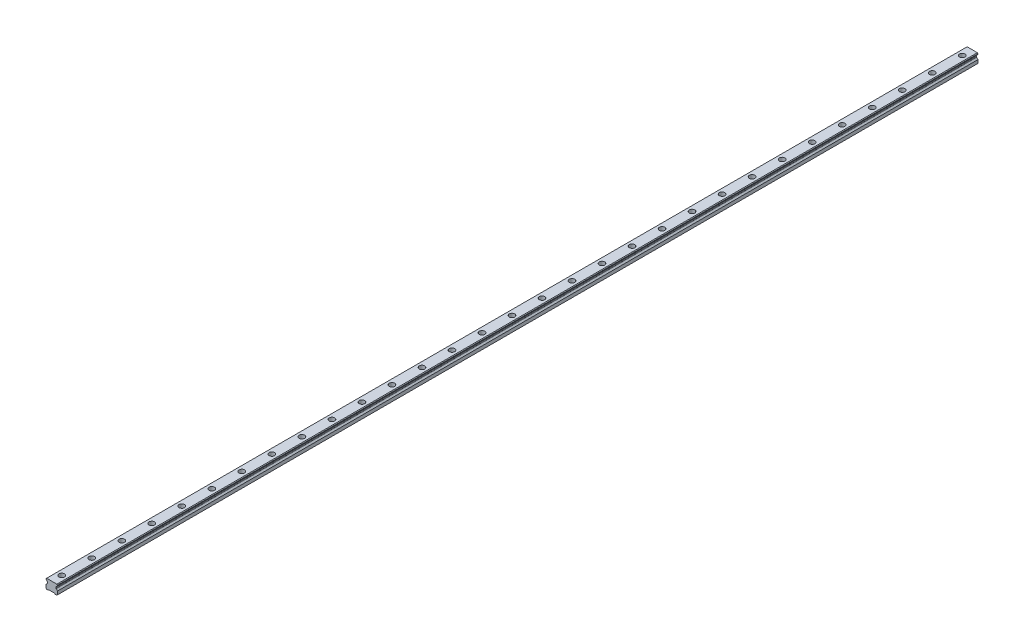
ISO-10303-21;
HEADER;
FILE_DESCRIPTION(('STEP AP214'),'2;1');
FILE_NAME('part.step','',(''),(''),'','','');
FILE_SCHEMA(('AUTOMOTIVE_DESIGN { 1 0 10303 214 1 1 1 1 }'));
ENDSEC;
DATA;
#1=APPLICATION_CONTEXT('core data for automotive mechanical design processes');
#2=APPLICATION_PROTOCOL_DEFINITION('international standard','automotive_design',2000,#1);
#3=PRODUCT_CONTEXT('',#1,'mechanical');
#4=PRODUCT('Part','Part','',(#3));
#5=PRODUCT_RELATED_PRODUCT_CATEGORY('part','',(#4));
#6=PRODUCT_DEFINITION_FORMATION('','',#4);
#7=PRODUCT_DEFINITION_CONTEXT('part definition',#1,'design');
#8=PRODUCT_DEFINITION('design','',#6,#7);
#9=PRODUCT_DEFINITION_SHAPE('','',#8);
#10=(LENGTH_UNIT() NAMED_UNIT(*) SI_UNIT(.MILLI.,.METRE.));
#11=(NAMED_UNIT(*) PLANE_ANGLE_UNIT() SI_UNIT($,.RADIAN.));
#12=(NAMED_UNIT(*) SI_UNIT($,.STERADIAN.) SOLID_ANGLE_UNIT());
#13=UNCERTAINTY_MEASURE_WITH_UNIT(LENGTH_MEASURE(1.E-05),#10,'distance_accuracy_value','');
#14=(GEOMETRIC_REPRESENTATION_CONTEXT(3) GLOBAL_UNCERTAINTY_ASSIGNED_CONTEXT((#13)) GLOBAL_UNIT_ASSIGNED_CONTEXT((#10,
#11,#12)) REPRESENTATION_CONTEXT('',''));
#15=CARTESIAN_POINT('',(0.,0.,0.));
#16=DIRECTION('',(0.,0.,1.));
#17=DIRECTION('',(1.,0.,0.));
#18=AXIS2_PLACEMENT_3D('',#15,#16,#17);
#19=CARTESIAN_POINT('',(0.,10.2,-900.));
#20=DIRECTION('',(0.,1.,0.));
#21=DIRECTION('',(0.,0.,1.));
#22=AXIS2_PLACEMENT_3D('',#19,#20,#21);
#23=PLANE('',#22);
#24=CARTESIAN_POINT('',(0.,10.2,-900.));
#25=DIRECTION('',(0.,1.,0.));
#26=DIRECTION('',(0.,0.,1.));
#27=AXIS2_PLACEMENT_3D('',#24,#25,#26);
#28=CIRCLE('',#27,3.5);
#29=CARTESIAN_POINT('',(0.,10.2,-896.5));
#30=VERTEX_POINT('',#29);
#31=EDGE_CURVE('E590',#30,#30,#28,.T.);
#32=ORIENTED_EDGE('',*,*,#31,.F.);
#33=EDGE_LOOP('',(#32));
#34=FACE_BOUND('',#33,.T.);
#35=CARTESIAN_POINT('',(0.,10.2,-900.));
#36=DIRECTION('',(0.,1.,0.));
#37=DIRECTION('',(0.,0.,1.));
#38=AXIS2_PLACEMENT_3D('',#35,#36,#37);
#39=CIRCLE('',#38,5.5);
#40=CARTESIAN_POINT('',(0.,10.2,-894.5));
#41=VERTEX_POINT('',#40);
#42=EDGE_CURVE('E11',#41,#41,#39,.T.);
#43=ORIENTED_EDGE('',*,*,#42,.T.);
#44=EDGE_LOOP('',(#43));
#45=FACE_BOUND('',#44,.T.);
#46=ADVANCED_FACE('F39',(#34,#45),#23,.T.);
#47=CARTESIAN_POINT('',(0.,10.2,-900.));
#48=DIRECTION('',(0.,1.,0.));
#49=DIRECTION('',(0.,0.,1.));
#50=AXIS2_PLACEMENT_3D('',#47,#48,#49);
#51=CYLINDRICAL_SURFACE('',#50,5.5);
#52=ORIENTED_EDGE('',*,*,#42,.F.);
#53=EDGE_LOOP('',(#52));
#54=FACE_BOUND('',#53,.T.);
#55=CARTESIAN_POINT('',(0.,19.2,-900.));
#56=DIRECTION('',(0.,1.,0.));
#57=DIRECTION('',(0.,0.,1.));
#58=AXIS2_PLACEMENT_3D('',#55,#56,#57);
#59=CIRCLE('',#58,5.5);
#60=CARTESIAN_POINT('',(0.,19.2,-894.5));
#61=VERTEX_POINT('',#60);
#62=EDGE_CURVE('E48',#61,#61,#59,.T.);
#63=ORIENTED_EDGE('',*,*,#62,.T.);
#64=EDGE_LOOP('',(#63));
#65=FACE_BOUND('',#64,.T.);
#66=ADVANCED_FACE('F1020',(#54,#65),#51,.F.);
#67=CARTESIAN_POINT('',(0.,10.2,-840.));
#68=DIRECTION('',(0.,1.,0.));
#69=DIRECTION('',(0.,0.,1.));
#70=AXIS2_PLACEMENT_3D('',#67,#68,#69);
#71=PLANE('',#70);
#72=CARTESIAN_POINT('',(0.,10.2,-840.));
#73=DIRECTION('',(0.,1.,0.));
#74=DIRECTION('',(0.,0.,1.));
#75=AXIS2_PLACEMENT_3D('',#72,#73,#74);
#76=CIRCLE('',#75,3.5);
#77=CARTESIAN_POINT('',(0.,10.2,-836.5));
#78=VERTEX_POINT('',#77);
#79=EDGE_CURVE('E595',#78,#78,#76,.T.);
#80=ORIENTED_EDGE('',*,*,#79,.F.);
#81=EDGE_LOOP('',(#80));
#82=FACE_BOUND('',#81,.T.);
#83=CARTESIAN_POINT('',(0.,10.2,-840.));
#84=DIRECTION('',(0.,1.,0.));
#85=DIRECTION('',(0.,0.,1.));
#86=AXIS2_PLACEMENT_3D('',#83,#84,#85);
#87=CIRCLE('',#86,5.5);
#88=CARTESIAN_POINT('',(0.,10.2,-834.5));
#89=VERTEX_POINT('',#88);
#90=EDGE_CURVE('E574',#89,#89,#87,.T.);
#91=ORIENTED_EDGE('',*,*,#90,.T.);
#92=EDGE_LOOP('',(#91));
#93=FACE_BOUND('',#92,.T.);
#94=ADVANCED_FACE('F1022',(#82,#93),#71,.T.);
#95=CARTESIAN_POINT('',(0.,10.2,-840.));
#96=DIRECTION('',(0.,1.,0.));
#97=DIRECTION('',(0.,0.,1.));
#98=AXIS2_PLACEMENT_3D('',#95,#96,#97);
#99=CYLINDRICAL_SURFACE('',#98,5.5);
#100=ORIENTED_EDGE('',*,*,#90,.F.);
#101=EDGE_LOOP('',(#100));
#102=FACE_BOUND('',#101,.T.);
#103=CARTESIAN_POINT('',(0.,19.2,-840.));
#104=DIRECTION('',(0.,1.,0.));
#105=DIRECTION('',(0.,0.,1.));
#106=AXIS2_PLACEMENT_3D('',#103,#104,#105);
#107=CIRCLE('',#106,5.5);
#108=CARTESIAN_POINT('',(0.,19.2,-834.5));
#109=VERTEX_POINT('',#108);
#110=EDGE_CURVE('E570',#109,#109,#107,.T.);
#111=ORIENTED_EDGE('',*,*,#110,.T.);
#112=EDGE_LOOP('',(#111));
#113=FACE_BOUND('',#112,.T.);
#114=ADVANCED_FACE('F1028',(#102,#113),#99,.F.);
#115=CARTESIAN_POINT('',(0.,10.2,-780.));
#116=DIRECTION('',(0.,1.,0.));
#117=DIRECTION('',(0.,0.,1.));
#118=AXIS2_PLACEMENT_3D('',#115,#116,#117);
#119=PLANE('',#118);
#120=CARTESIAN_POINT('',(0.,10.2,-780.));
#121=DIRECTION('',(0.,1.,0.));
#122=DIRECTION('',(0.,0.,1.));
#123=AXIS2_PLACEMENT_3D('',#120,#121,#122);
#124=CIRCLE('',#123,3.5);
#125=CARTESIAN_POINT('',(0.,10.2,-776.5));
#126=VERTEX_POINT('',#125);
#127=EDGE_CURVE('E600',#126,#126,#124,.T.);
#128=ORIENTED_EDGE('',*,*,#127,.F.);
#129=EDGE_LOOP('',(#128));
#130=FACE_BOUND('',#129,.T.);
#131=CARTESIAN_POINT('',(0.,10.2,-780.));
#132=DIRECTION('',(0.,1.,0.));
#133=DIRECTION('',(0.,0.,1.));
#134=AXIS2_PLACEMENT_3D('',#131,#132,#133);
#135=CIRCLE('',#134,5.5);
#136=CARTESIAN_POINT('',(0.,10.2,-774.5));
#137=VERTEX_POINT('',#136);
#138=EDGE_CURVE('E566',#137,#137,#135,.T.);
#139=ORIENTED_EDGE('',*,*,#138,.T.);
#140=EDGE_LOOP('',(#139));
#141=FACE_BOUND('',#140,.T.);
#142=ADVANCED_FACE('F1036',(#130,#141),#119,.T.);
#143=CARTESIAN_POINT('',(0.,10.2,-780.));
#144=DIRECTION('',(0.,1.,0.));
#145=DIRECTION('',(0.,0.,1.));
#146=AXIS2_PLACEMENT_3D('',#143,#144,#145);
#147=CYLINDRICAL_SURFACE('',#146,5.5);
#148=ORIENTED_EDGE('',*,*,#138,.F.);
#149=EDGE_LOOP('',(#148));
#150=FACE_BOUND('',#149,.T.);
#151=CARTESIAN_POINT('',(0.,19.2,-780.));
#152=DIRECTION('',(0.,1.,0.));
#153=DIRECTION('',(0.,0.,1.));
#154=AXIS2_PLACEMENT_3D('',#151,#152,#153);
#155=CIRCLE('',#154,5.5);
#156=CARTESIAN_POINT('',(0.,19.2,-774.5));
#157=VERTEX_POINT('',#156);
#158=EDGE_CURVE('E562',#157,#157,#155,.T.);
#159=ORIENTED_EDGE('',*,*,#158,.T.);
#160=EDGE_LOOP('',(#159));
#161=FACE_BOUND('',#160,.T.);
#162=ADVANCED_FACE('F1040',(#150,#161),#147,.F.);
#163=CARTESIAN_POINT('',(0.,10.2,-720.));
#164=DIRECTION('',(0.,1.,0.));
#165=DIRECTION('',(0.,0.,1.));
#166=AXIS2_PLACEMENT_3D('',#163,#164,#165);
#167=PLANE('',#166);
#168=CARTESIAN_POINT('',(0.,10.2,-720.));
#169=DIRECTION('',(0.,1.,0.));
#170=DIRECTION('',(0.,0.,1.));
#171=AXIS2_PLACEMENT_3D('',#168,#169,#170);
#172=CIRCLE('',#171,3.5);
#173=CARTESIAN_POINT('',(0.,10.2,-716.5));
#174=VERTEX_POINT('',#173);
#175=EDGE_CURVE('E605',#174,#174,#172,.T.);
#176=ORIENTED_EDGE('',*,*,#175,.F.);
#177=EDGE_LOOP('',(#176));
#178=FACE_BOUND('',#177,.T.);
#179=CARTESIAN_POINT('',(0.,10.2,-720.));
#180=DIRECTION('',(0.,1.,0.));
#181=DIRECTION('',(0.,0.,1.));
#182=AXIS2_PLACEMENT_3D('',#179,#180,#181);
#183=CIRCLE('',#182,5.5);
#184=CARTESIAN_POINT('',(0.,10.2,-714.5));
#185=VERTEX_POINT('',#184);
#186=EDGE_CURVE('E558',#185,#185,#183,.T.);
#187=ORIENTED_EDGE('',*,*,#186,.T.);
#188=EDGE_LOOP('',(#187));
#189=FACE_BOUND('',#188,.T.);
#190=ADVANCED_FACE('F1044',(#178,#189),#167,.T.);
#191=CARTESIAN_POINT('',(0.,10.2,-720.));
#192=DIRECTION('',(0.,1.,0.));
#193=DIRECTION('',(0.,0.,1.));
#194=AXIS2_PLACEMENT_3D('',#191,#192,#193);
#195=CYLINDRICAL_SURFACE('',#194,5.5);
#196=ORIENTED_EDGE('',*,*,#186,.F.);
#197=EDGE_LOOP('',(#196));
#198=FACE_BOUND('',#197,.T.);
#199=CARTESIAN_POINT('',(0.,19.2,-720.));
#200=DIRECTION('',(0.,1.,0.));
#201=DIRECTION('',(0.,0.,1.));
#202=AXIS2_PLACEMENT_3D('',#199,#200,#201);
#203=CIRCLE('',#202,5.5);
#204=CARTESIAN_POINT('',(0.,19.2,-714.5));
#205=VERTEX_POINT('',#204);
#206=EDGE_CURVE('E554',#205,#205,#203,.T.);
#207=ORIENTED_EDGE('',*,*,#206,.T.);
#208=EDGE_LOOP('',(#207));
#209=FACE_BOUND('',#208,.T.);
#210=ADVANCED_FACE('F1048',(#198,#209),#195,.F.);
#211=CARTESIAN_POINT('',(0.,10.2,-660.));
#212=DIRECTION('',(0.,1.,0.));
#213=DIRECTION('',(0.,0.,1.));
#214=AXIS2_PLACEMENT_3D('',#211,#212,#213);
#215=PLANE('',#214);
#216=CARTESIAN_POINT('',(0.,10.2,-660.));
#217=DIRECTION('',(0.,1.,0.));
#218=DIRECTION('',(0.,0.,1.));
#219=AXIS2_PLACEMENT_3D('',#216,#217,#218);
#220=CIRCLE('',#219,3.5);
#221=CARTESIAN_POINT('',(0.,10.2,-656.5));
#222=VERTEX_POINT('',#221);
#223=EDGE_CURVE('E610',#222,#222,#220,.T.);
#224=ORIENTED_EDGE('',*,*,#223,.F.);
#225=EDGE_LOOP('',(#224));
#226=FACE_BOUND('',#225,.T.);
#227=CARTESIAN_POINT('',(0.,10.2,-660.));
#228=DIRECTION('',(0.,1.,0.));
#229=DIRECTION('',(0.,0.,1.));
#230=AXIS2_PLACEMENT_3D('',#227,#228,#229);
#231=CIRCLE('',#230,5.5);
#232=CARTESIAN_POINT('',(0.,10.2,-654.5));
#233=VERTEX_POINT('',#232);
#234=EDGE_CURVE('E550',#233,#233,#231,.T.);
#235=ORIENTED_EDGE('',*,*,#234,.T.);
#236=EDGE_LOOP('',(#235));
#237=FACE_BOUND('',#236,.T.);
#238=ADVANCED_FACE('F1052',(#226,#237),#215,.T.);
#239=CARTESIAN_POINT('',(0.,10.2,-660.));
#240=DIRECTION('',(0.,1.,0.));
#241=DIRECTION('',(0.,0.,1.));
#242=AXIS2_PLACEMENT_3D('',#239,#240,#241);
#243=CYLINDRICAL_SURFACE('',#242,5.5);
#244=ORIENTED_EDGE('',*,*,#234,.F.);
#245=EDGE_LOOP('',(#244));
#246=FACE_BOUND('',#245,.T.);
#247=CARTESIAN_POINT('',(0.,19.2,-660.));
#248=DIRECTION('',(0.,1.,0.));
#249=DIRECTION('',(0.,0.,1.));
#250=AXIS2_PLACEMENT_3D('',#247,#248,#249);
#251=CIRCLE('',#250,5.5);
#252=CARTESIAN_POINT('',(0.,19.2,-654.5));
#253=VERTEX_POINT('',#252);
#254=EDGE_CURVE('E546',#253,#253,#251,.T.);
#255=ORIENTED_EDGE('',*,*,#254,.T.);
#256=EDGE_LOOP('',(#255));
#257=FACE_BOUND('',#256,.T.);
#258=ADVANCED_FACE('F1056',(#246,#257),#243,.F.);
#259=CARTESIAN_POINT('',(0.,10.2,-600.));
#260=DIRECTION('',(0.,1.,0.));
#261=DIRECTION('',(0.,0.,1.));
#262=AXIS2_PLACEMENT_3D('',#259,#260,#261);
#263=PLANE('',#262);
#264=CARTESIAN_POINT('',(0.,10.2,-600.));
#265=DIRECTION('',(0.,1.,0.));
#266=DIRECTION('',(0.,0.,1.));
#267=AXIS2_PLACEMENT_3D('',#264,#265,#266);
#268=CIRCLE('',#267,3.5);
#269=CARTESIAN_POINT('',(0.,10.2,-596.5));
#270=VERTEX_POINT('',#269);
#271=EDGE_CURVE('E615',#270,#270,#268,.T.);
#272=ORIENTED_EDGE('',*,*,#271,.F.);
#273=EDGE_LOOP('',(#272));
#274=FACE_BOUND('',#273,.T.);
#275=CARTESIAN_POINT('',(0.,10.2,-600.));
#276=DIRECTION('',(0.,1.,0.));
#277=DIRECTION('',(0.,0.,1.));
#278=AXIS2_PLACEMENT_3D('',#275,#276,#277);
#279=CIRCLE('',#278,5.5);
#280=CARTESIAN_POINT('',(0.,10.2,-594.5));
#281=VERTEX_POINT('',#280);
#282=EDGE_CURVE('E542',#281,#281,#279,.T.);
#283=ORIENTED_EDGE('',*,*,#282,.T.);
#284=EDGE_LOOP('',(#283));
#285=FACE_BOUND('',#284,.T.);
#286=ADVANCED_FACE('F1060',(#274,#285),#263,.T.);
#287=CARTESIAN_POINT('',(0.,10.2,-600.));
#288=DIRECTION('',(0.,1.,0.));
#289=DIRECTION('',(0.,0.,1.));
#290=AXIS2_PLACEMENT_3D('',#287,#288,#289);
#291=CYLINDRICAL_SURFACE('',#290,5.5);
#292=ORIENTED_EDGE('',*,*,#282,.F.);
#293=EDGE_LOOP('',(#292));
#294=FACE_BOUND('',#293,.T.);
#295=CARTESIAN_POINT('',(0.,19.2,-600.));
#296=DIRECTION('',(0.,1.,0.));
#297=DIRECTION('',(0.,0.,1.));
#298=AXIS2_PLACEMENT_3D('',#295,#296,#297);
#299=CIRCLE('',#298,5.5);
#300=CARTESIAN_POINT('',(0.,19.2,-594.5));
#301=VERTEX_POINT('',#300);
#302=EDGE_CURVE('E538',#301,#301,#299,.T.);
#303=ORIENTED_EDGE('',*,*,#302,.T.);
#304=EDGE_LOOP('',(#303));
#305=FACE_BOUND('',#304,.T.);
#306=ADVANCED_FACE('F1064',(#294,#305),#291,.F.);
#307=CARTESIAN_POINT('',(0.,10.2,-540.));
#308=DIRECTION('',(0.,1.,0.));
#309=DIRECTION('',(0.,0.,1.));
#310=AXIS2_PLACEMENT_3D('',#307,#308,#309);
#311=PLANE('',#310);
#312=CARTESIAN_POINT('',(0.,10.2,-540.));
#313=DIRECTION('',(0.,1.,0.));
#314=DIRECTION('',(0.,0.,1.));
#315=AXIS2_PLACEMENT_3D('',#312,#313,#314);
#316=CIRCLE('',#315,3.5);
#317=CARTESIAN_POINT('',(0.,10.2,-536.5));
#318=VERTEX_POINT('',#317);
#319=EDGE_CURVE('E620',#318,#318,#316,.T.);
#320=ORIENTED_EDGE('',*,*,#319,.F.);
#321=EDGE_LOOP('',(#320));
#322=FACE_BOUND('',#321,.T.);
#323=CARTESIAN_POINT('',(0.,10.2,-540.));
#324=DIRECTION('',(0.,1.,0.));
#325=DIRECTION('',(0.,0.,1.));
#326=AXIS2_PLACEMENT_3D('',#323,#324,#325);
#327=CIRCLE('',#326,5.5);
#328=CARTESIAN_POINT('',(0.,10.2,-534.5));
#329=VERTEX_POINT('',#328);
#330=EDGE_CURVE('E534',#329,#329,#327,.T.);
#331=ORIENTED_EDGE('',*,*,#330,.T.);
#332=EDGE_LOOP('',(#331));
#333=FACE_BOUND('',#332,.T.);
#334=ADVANCED_FACE('F1068',(#322,#333),#311,.T.);
#335=CARTESIAN_POINT('',(0.,10.2,-540.));
#336=DIRECTION('',(0.,1.,0.));
#337=DIRECTION('',(0.,0.,1.));
#338=AXIS2_PLACEMENT_3D('',#335,#336,#337);
#339=CYLINDRICAL_SURFACE('',#338,5.5);
#340=ORIENTED_EDGE('',*,*,#330,.F.);
#341=EDGE_LOOP('',(#340));
#342=FACE_BOUND('',#341,.T.);
#343=CARTESIAN_POINT('',(0.,19.2,-540.));
#344=DIRECTION('',(0.,1.,0.));
#345=DIRECTION('',(0.,0.,1.));
#346=AXIS2_PLACEMENT_3D('',#343,#344,#345);
#347=CIRCLE('',#346,5.5);
#348=CARTESIAN_POINT('',(0.,19.2,-534.5));
#349=VERTEX_POINT('',#348);
#350=EDGE_CURVE('E530',#349,#349,#347,.T.);
#351=ORIENTED_EDGE('',*,*,#350,.T.);
#352=EDGE_LOOP('',(#351));
#353=FACE_BOUND('',#352,.T.);
#354=ADVANCED_FACE('F1072',(#342,#353),#339,.F.);
#355=CARTESIAN_POINT('',(0.,10.2,-480.));
#356=DIRECTION('',(0.,1.,0.));
#357=DIRECTION('',(0.,0.,1.));
#358=AXIS2_PLACEMENT_3D('',#355,#356,#357);
#359=PLANE('',#358);
#360=CARTESIAN_POINT('',(0.,10.2,-480.));
#361=DIRECTION('',(0.,1.,0.));
#362=DIRECTION('',(0.,0.,1.));
#363=AXIS2_PLACEMENT_3D('',#360,#361,#362);
#364=CIRCLE('',#363,3.5);
#365=CARTESIAN_POINT('',(0.,10.2,-476.5));
#366=VERTEX_POINT('',#365);
#367=EDGE_CURVE('E625',#366,#366,#364,.T.);
#368=ORIENTED_EDGE('',*,*,#367,.F.);
#369=EDGE_LOOP('',(#368));
#370=FACE_BOUND('',#369,.T.);
#371=CARTESIAN_POINT('',(0.,10.2,-480.));
#372=DIRECTION('',(0.,1.,0.));
#373=DIRECTION('',(0.,0.,1.));
#374=AXIS2_PLACEMENT_3D('',#371,#372,#373);
#375=CIRCLE('',#374,5.5);
#376=CARTESIAN_POINT('',(0.,10.2,-474.5));
#377=VERTEX_POINT('',#376);
#378=EDGE_CURVE('E526',#377,#377,#375,.T.);
#379=ORIENTED_EDGE('',*,*,#378,.T.);
#380=EDGE_LOOP('',(#379));
#381=FACE_BOUND('',#380,.T.);
#382=ADVANCED_FACE('F1076',(#370,#381),#359,.T.);
#383=CARTESIAN_POINT('',(0.,10.2,-480.));
#384=DIRECTION('',(0.,1.,0.));
#385=DIRECTION('',(0.,0.,1.));
#386=AXIS2_PLACEMENT_3D('',#383,#384,#385);
#387=CYLINDRICAL_SURFACE('',#386,5.5);
#388=ORIENTED_EDGE('',*,*,#378,.F.);
#389=EDGE_LOOP('',(#388));
#390=FACE_BOUND('',#389,.T.);
#391=CARTESIAN_POINT('',(0.,19.2,-480.));
#392=DIRECTION('',(0.,1.,0.));
#393=DIRECTION('',(0.,0.,1.));
#394=AXIS2_PLACEMENT_3D('',#391,#392,#393);
#395=CIRCLE('',#394,5.5);
#396=CARTESIAN_POINT('',(0.,19.2,-474.5));
#397=VERTEX_POINT('',#396);
#398=EDGE_CURVE('E522',#397,#397,#395,.T.);
#399=ORIENTED_EDGE('',*,*,#398,.T.);
#400=EDGE_LOOP('',(#399));
#401=FACE_BOUND('',#400,.T.);
#402=ADVANCED_FACE('F1080',(#390,#401),#387,.F.);
#403=CARTESIAN_POINT('',(0.,10.2,-420.));
#404=DIRECTION('',(0.,1.,0.));
#405=DIRECTION('',(0.,0.,1.));
#406=AXIS2_PLACEMENT_3D('',#403,#404,#405);
#407=PLANE('',#406);
#408=CARTESIAN_POINT('',(0.,10.2,-420.));
#409=DIRECTION('',(0.,1.,0.));
#410=DIRECTION('',(0.,0.,1.));
#411=AXIS2_PLACEMENT_3D('',#408,#409,#410);
#412=CIRCLE('',#411,3.5);
#413=CARTESIAN_POINT('',(0.,10.2,-416.5));
#414=VERTEX_POINT('',#413);
#415=EDGE_CURVE('E630',#414,#414,#412,.T.);
#416=ORIENTED_EDGE('',*,*,#415,.F.);
#417=EDGE_LOOP('',(#416));
#418=FACE_BOUND('',#417,.T.);
#419=CARTESIAN_POINT('',(0.,10.2,-420.));
#420=DIRECTION('',(0.,1.,0.));
#421=DIRECTION('',(0.,0.,1.));
#422=AXIS2_PLACEMENT_3D('',#419,#420,#421);
#423=CIRCLE('',#422,5.5);
#424=CARTESIAN_POINT('',(0.,10.2,-414.5));
#425=VERTEX_POINT('',#424);
#426=EDGE_CURVE('E518',#425,#425,#423,.T.);
#427=ORIENTED_EDGE('',*,*,#426,.T.);
#428=EDGE_LOOP('',(#427));
#429=FACE_BOUND('',#428,.T.);
#430=ADVANCED_FACE('F1084',(#418,#429),#407,.T.);
#431=CARTESIAN_POINT('',(0.,10.2,-420.));
#432=DIRECTION('',(0.,1.,0.));
#433=DIRECTION('',(0.,0.,1.));
#434=AXIS2_PLACEMENT_3D('',#431,#432,#433);
#435=CYLINDRICAL_SURFACE('',#434,5.5);
#436=ORIENTED_EDGE('',*,*,#426,.F.);
#437=EDGE_LOOP('',(#436));
#438=FACE_BOUND('',#437,.T.);
#439=CARTESIAN_POINT('',(0.,19.2,-420.));
#440=DIRECTION('',(0.,1.,0.));
#441=DIRECTION('',(0.,0.,1.));
#442=AXIS2_PLACEMENT_3D('',#439,#440,#441);
#443=CIRCLE('',#442,5.5);
#444=CARTESIAN_POINT('',(0.,19.2,-414.5));
#445=VERTEX_POINT('',#444);
#446=EDGE_CURVE('E514',#445,#445,#443,.T.);
#447=ORIENTED_EDGE('',*,*,#446,.T.);
#448=EDGE_LOOP('',(#447));
#449=FACE_BOUND('',#448,.T.);
#450=ADVANCED_FACE('F1088',(#438,#449),#435,.F.);
#451=CARTESIAN_POINT('',(0.,10.2,-360.));
#452=DIRECTION('',(0.,1.,0.));
#453=DIRECTION('',(0.,0.,1.));
#454=AXIS2_PLACEMENT_3D('',#451,#452,#453);
#455=PLANE('',#454);
#456=CARTESIAN_POINT('',(0.,10.2,-360.));
#457=DIRECTION('',(0.,1.,0.));
#458=DIRECTION('',(0.,0.,1.));
#459=AXIS2_PLACEMENT_3D('',#456,#457,#458);
#460=CIRCLE('',#459,3.5);
#461=CARTESIAN_POINT('',(0.,10.2,-356.5));
#462=VERTEX_POINT('',#461);
#463=EDGE_CURVE('E635',#462,#462,#460,.T.);
#464=ORIENTED_EDGE('',*,*,#463,.F.);
#465=EDGE_LOOP('',(#464));
#466=FACE_BOUND('',#465,.T.);
#467=CARTESIAN_POINT('',(0.,10.2,-360.));
#468=DIRECTION('',(0.,1.,0.));
#469=DIRECTION('',(0.,0.,1.));
#470=AXIS2_PLACEMENT_3D('',#467,#468,#469);
#471=CIRCLE('',#470,5.5);
#472=CARTESIAN_POINT('',(0.,10.2,-354.5));
#473=VERTEX_POINT('',#472);
#474=EDGE_CURVE('E510',#473,#473,#471,.T.);
#475=ORIENTED_EDGE('',*,*,#474,.T.);
#476=EDGE_LOOP('',(#475));
#477=FACE_BOUND('',#476,.T.);
#478=ADVANCED_FACE('F1092',(#466,#477),#455,.T.);
#479=CARTESIAN_POINT('',(0.,10.2,-360.));
#480=DIRECTION('',(0.,1.,0.));
#481=DIRECTION('',(0.,0.,1.));
#482=AXIS2_PLACEMENT_3D('',#479,#480,#481);
#483=CYLINDRICAL_SURFACE('',#482,5.5);
#484=ORIENTED_EDGE('',*,*,#474,.F.);
#485=EDGE_LOOP('',(#484));
#486=FACE_BOUND('',#485,.T.);
#487=CARTESIAN_POINT('',(0.,19.2,-360.));
#488=DIRECTION('',(0.,1.,0.));
#489=DIRECTION('',(0.,0.,1.));
#490=AXIS2_PLACEMENT_3D('',#487,#488,#489);
#491=CIRCLE('',#490,5.5);
#492=CARTESIAN_POINT('',(0.,19.2,-354.5));
#493=VERTEX_POINT('',#492);
#494=EDGE_CURVE('E506',#493,#493,#491,.T.);
#495=ORIENTED_EDGE('',*,*,#494,.T.);
#496=EDGE_LOOP('',(#495));
#497=FACE_BOUND('',#496,.T.);
#498=ADVANCED_FACE('F1096',(#486,#497),#483,.F.);
#499=CARTESIAN_POINT('',(0.,10.2,-300.));
#500=DIRECTION('',(0.,1.,0.));
#501=DIRECTION('',(0.,0.,1.));
#502=AXIS2_PLACEMENT_3D('',#499,#500,#501);
#503=PLANE('',#502);
#504=CARTESIAN_POINT('',(0.,10.2,-300.));
#505=DIRECTION('',(0.,1.,0.));
#506=DIRECTION('',(0.,0.,1.));
#507=AXIS2_PLACEMENT_3D('',#504,#505,#506);
#508=CIRCLE('',#507,3.5);
#509=CARTESIAN_POINT('',(0.,10.2,-296.5));
#510=VERTEX_POINT('',#509);
#511=EDGE_CURVE('E640',#510,#510,#508,.T.);
#512=ORIENTED_EDGE('',*,*,#511,.F.);
#513=EDGE_LOOP('',(#512));
#514=FACE_BOUND('',#513,.T.);
#515=CARTESIAN_POINT('',(0.,10.2,-300.));
#516=DIRECTION('',(0.,1.,0.));
#517=DIRECTION('',(0.,0.,1.));
#518=AXIS2_PLACEMENT_3D('',#515,#516,#517);
#519=CIRCLE('',#518,5.5);
#520=CARTESIAN_POINT('',(0.,10.2,-294.5));
#521=VERTEX_POINT('',#520);
#522=EDGE_CURVE('E502',#521,#521,#519,.T.);
#523=ORIENTED_EDGE('',*,*,#522,.T.);
#524=EDGE_LOOP('',(#523));
#525=FACE_BOUND('',#524,.T.);
#526=ADVANCED_FACE('F1100',(#514,#525),#503,.T.);
#527=CARTESIAN_POINT('',(0.,10.2,-300.));
#528=DIRECTION('',(0.,1.,0.));
#529=DIRECTION('',(0.,0.,1.));
#530=AXIS2_PLACEMENT_3D('',#527,#528,#529);
#531=CYLINDRICAL_SURFACE('',#530,5.5);
#532=ORIENTED_EDGE('',*,*,#522,.F.);
#533=EDGE_LOOP('',(#532));
#534=FACE_BOUND('',#533,.T.);
#535=CARTESIAN_POINT('',(0.,19.2,-300.));
#536=DIRECTION('',(0.,1.,0.));
#537=DIRECTION('',(0.,0.,1.));
#538=AXIS2_PLACEMENT_3D('',#535,#536,#537);
#539=CIRCLE('',#538,5.5);
#540=CARTESIAN_POINT('',(0.,19.2,-294.5));
#541=VERTEX_POINT('',#540);
#542=EDGE_CURVE('E498',#541,#541,#539,.T.);
#543=ORIENTED_EDGE('',*,*,#542,.T.);
#544=EDGE_LOOP('',(#543));
#545=FACE_BOUND('',#544,.T.);
#546=ADVANCED_FACE('F1104',(#534,#545),#531,.F.);
#547=CARTESIAN_POINT('',(0.,10.2,-240.));
#548=DIRECTION('',(0.,1.,0.));
#549=DIRECTION('',(0.,0.,1.));
#550=AXIS2_PLACEMENT_3D('',#547,#548,#549);
#551=PLANE('',#550);
#552=CARTESIAN_POINT('',(0.,10.2,-240.));
#553=DIRECTION('',(0.,1.,0.));
#554=DIRECTION('',(0.,0.,1.));
#555=AXIS2_PLACEMENT_3D('',#552,#553,#554);
#556=CIRCLE('',#555,3.5);
#557=CARTESIAN_POINT('',(0.,10.2,-236.5));
#558=VERTEX_POINT('',#557);
#559=EDGE_CURVE('E645',#558,#558,#556,.T.);
#560=ORIENTED_EDGE('',*,*,#559,.F.);
#561=EDGE_LOOP('',(#560));
#562=FACE_BOUND('',#561,.T.);
#563=CARTESIAN_POINT('',(0.,10.2,-240.));
#564=DIRECTION('',(0.,1.,0.));
#565=DIRECTION('',(0.,0.,1.));
#566=AXIS2_PLACEMENT_3D('',#563,#564,#565);
#567=CIRCLE('',#566,5.5);
#568=CARTESIAN_POINT('',(0.,10.2,-234.5));
#569=VERTEX_POINT('',#568);
#570=EDGE_CURVE('E494',#569,#569,#567,.T.);
#571=ORIENTED_EDGE('',*,*,#570,.T.);
#572=EDGE_LOOP('',(#571));
#573=FACE_BOUND('',#572,.T.);
#574=ADVANCED_FACE('F1108',(#562,#573),#551,.T.);
#575=CARTESIAN_POINT('',(0.,10.2,-240.));
#576=DIRECTION('',(0.,1.,0.));
#577=DIRECTION('',(0.,0.,1.));
#578=AXIS2_PLACEMENT_3D('',#575,#576,#577);
#579=CYLINDRICAL_SURFACE('',#578,5.5);
#580=ORIENTED_EDGE('',*,*,#570,.F.);
#581=EDGE_LOOP('',(#580));
#582=FACE_BOUND('',#581,.T.);
#583=CARTESIAN_POINT('',(0.,19.2,-240.));
#584=DIRECTION('',(0.,1.,0.));
#585=DIRECTION('',(0.,0.,1.));
#586=AXIS2_PLACEMENT_3D('',#583,#584,#585);
#587=CIRCLE('',#586,5.5);
#588=CARTESIAN_POINT('',(0.,19.2,-234.5));
#589=VERTEX_POINT('',#588);
#590=EDGE_CURVE('E490',#589,#589,#587,.T.);
#591=ORIENTED_EDGE('',*,*,#590,.T.);
#592=EDGE_LOOP('',(#591));
#593=FACE_BOUND('',#592,.T.);
#594=ADVANCED_FACE('F1112',(#582,#593),#579,.F.);
#595=CARTESIAN_POINT('',(0.,10.2,-180.));
#596=DIRECTION('',(0.,1.,0.));
#597=DIRECTION('',(0.,0.,1.));
#598=AXIS2_PLACEMENT_3D('',#595,#596,#597);
#599=PLANE('',#598);
#600=CARTESIAN_POINT('',(0.,10.2,-180.));
#601=DIRECTION('',(0.,1.,0.));
#602=DIRECTION('',(0.,0.,1.));
#603=AXIS2_PLACEMENT_3D('',#600,#601,#602);
#604=CIRCLE('',#603,3.5);
#605=CARTESIAN_POINT('',(0.,10.2,-176.5));
#606=VERTEX_POINT('',#605);
#607=EDGE_CURVE('E650',#606,#606,#604,.T.);
#608=ORIENTED_EDGE('',*,*,#607,.F.);
#609=EDGE_LOOP('',(#608));
#610=FACE_BOUND('',#609,.T.);
#611=CARTESIAN_POINT('',(0.,10.2,-180.));
#612=DIRECTION('',(0.,1.,0.));
#613=DIRECTION('',(0.,0.,1.));
#614=AXIS2_PLACEMENT_3D('',#611,#612,#613);
#615=CIRCLE('',#614,5.5);
#616=CARTESIAN_POINT('',(0.,10.2,-174.5));
#617=VERTEX_POINT('',#616);
#618=EDGE_CURVE('E486',#617,#617,#615,.T.);
#619=ORIENTED_EDGE('',*,*,#618,.T.);
#620=EDGE_LOOP('',(#619));
#621=FACE_BOUND('',#620,.T.);
#622=ADVANCED_FACE('F1116',(#610,#621),#599,.T.);
#623=CARTESIAN_POINT('',(0.,10.2,-180.));
#624=DIRECTION('',(0.,1.,0.));
#625=DIRECTION('',(0.,0.,1.));
#626=AXIS2_PLACEMENT_3D('',#623,#624,#625);
#627=CYLINDRICAL_SURFACE('',#626,5.5);
#628=ORIENTED_EDGE('',*,*,#618,.F.);
#629=EDGE_LOOP('',(#628));
#630=FACE_BOUND('',#629,.T.);
#631=CARTESIAN_POINT('',(0.,19.2,-180.));
#632=DIRECTION('',(0.,1.,0.));
#633=DIRECTION('',(0.,0.,1.));
#634=AXIS2_PLACEMENT_3D('',#631,#632,#633);
#635=CIRCLE('',#634,5.5);
#636=CARTESIAN_POINT('',(0.,19.2,-174.5));
#637=VERTEX_POINT('',#636);
#638=EDGE_CURVE('E482',#637,#637,#635,.T.);
#639=ORIENTED_EDGE('',*,*,#638,.T.);
#640=EDGE_LOOP('',(#639));
#641=FACE_BOUND('',#640,.T.);
#642=ADVANCED_FACE('F1120',(#630,#641),#627,.F.);
#643=CARTESIAN_POINT('',(0.,10.2,-120.));
#644=DIRECTION('',(0.,1.,0.));
#645=DIRECTION('',(0.,0.,1.));
#646=AXIS2_PLACEMENT_3D('',#643,#644,#645);
#647=PLANE('',#646);
#648=CARTESIAN_POINT('',(0.,10.2,-120.));
#649=DIRECTION('',(0.,1.,0.));
#650=DIRECTION('',(0.,0.,1.));
#651=AXIS2_PLACEMENT_3D('',#648,#649,#650);
#652=CIRCLE('',#651,3.5);
#653=CARTESIAN_POINT('',(0.,10.2,-116.5));
#654=VERTEX_POINT('',#653);
#655=EDGE_CURVE('E655',#654,#654,#652,.T.);
#656=ORIENTED_EDGE('',*,*,#655,.F.);
#657=EDGE_LOOP('',(#656));
#658=FACE_BOUND('',#657,.T.);
#659=CARTESIAN_POINT('',(0.,10.2,-120.));
#660=DIRECTION('',(0.,1.,0.));
#661=DIRECTION('',(0.,0.,1.));
#662=AXIS2_PLACEMENT_3D('',#659,#660,#661);
#663=CIRCLE('',#662,5.5);
#664=CARTESIAN_POINT('',(0.,10.2,-114.5));
#665=VERTEX_POINT('',#664);
#666=EDGE_CURVE('E478',#665,#665,#663,.T.);
#667=ORIENTED_EDGE('',*,*,#666,.T.);
#668=EDGE_LOOP('',(#667));
#669=FACE_BOUND('',#668,.T.);
#670=ADVANCED_FACE('F1124',(#658,#669),#647,.T.);
#671=CARTESIAN_POINT('',(0.,10.2,-120.));
#672=DIRECTION('',(0.,1.,0.));
#673=DIRECTION('',(0.,0.,1.));
#674=AXIS2_PLACEMENT_3D('',#671,#672,#673);
#675=CYLINDRICAL_SURFACE('',#674,5.5);
#676=ORIENTED_EDGE('',*,*,#666,.F.);
#677=EDGE_LOOP('',(#676));
#678=FACE_BOUND('',#677,.T.);
#679=CARTESIAN_POINT('',(0.,19.2,-120.));
#680=DIRECTION('',(0.,1.,0.));
#681=DIRECTION('',(0.,0.,1.));
#682=AXIS2_PLACEMENT_3D('',#679,#680,#681);
#683=CIRCLE('',#682,5.5);
#684=CARTESIAN_POINT('',(0.,19.2,-114.5));
#685=VERTEX_POINT('',#684);
#686=EDGE_CURVE('E474',#685,#685,#683,.T.);
#687=ORIENTED_EDGE('',*,*,#686,.T.);
#688=EDGE_LOOP('',(#687));
#689=FACE_BOUND('',#688,.T.);
#690=ADVANCED_FACE('F1128',(#678,#689),#675,.F.);
#691=CARTESIAN_POINT('',(0.,10.2,-59.9999999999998));
#692=DIRECTION('',(0.,1.,0.));
#693=DIRECTION('',(0.,0.,1.));
#694=AXIS2_PLACEMENT_3D('',#691,#692,#693);
#695=PLANE('',#694);
#696=CARTESIAN_POINT('',(0.,10.2,-59.9999999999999));
#697=DIRECTION('',(0.,1.,0.));
#698=DIRECTION('',(0.,0.,1.));
#699=AXIS2_PLACEMENT_3D('',#696,#697,#698);
#700=CIRCLE('',#699,3.5);
#701=CARTESIAN_POINT('',(0.,10.2,-56.4999999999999));
#702=VERTEX_POINT('',#701);
#703=EDGE_CURVE('E660',#702,#702,#700,.T.);
#704=ORIENTED_EDGE('',*,*,#703,.F.);
#705=EDGE_LOOP('',(#704));
#706=FACE_BOUND('',#705,.T.);
#707=CARTESIAN_POINT('',(0.,10.2,-59.9999999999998));
#708=DIRECTION('',(0.,1.,0.));
#709=DIRECTION('',(0.,0.,1.));
#710=AXIS2_PLACEMENT_3D('',#707,#708,#709);
#711=CIRCLE('',#710,5.5);
#712=CARTESIAN_POINT('',(0.,10.2,-54.4999999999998));
#713=VERTEX_POINT('',#712);
#714=EDGE_CURVE('E470',#713,#713,#711,.T.);
#715=ORIENTED_EDGE('',*,*,#714,.T.);
#716=EDGE_LOOP('',(#715));
#717=FACE_BOUND('',#716,.T.);
#718=ADVANCED_FACE('F1132',(#706,#717),#695,.T.);
#719=CARTESIAN_POINT('',(0.,10.2,-59.9999999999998));
#720=DIRECTION('',(0.,1.,0.));
#721=DIRECTION('',(0.,0.,1.));
#722=AXIS2_PLACEMENT_3D('',#719,#720,#721);
#723=CYLINDRICAL_SURFACE('',#722,5.5);
#724=ORIENTED_EDGE('',*,*,#714,.F.);
#725=EDGE_LOOP('',(#724));
#726=FACE_BOUND('',#725,.T.);
#727=CARTESIAN_POINT('',(0.,19.2,-59.9999999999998));
#728=DIRECTION('',(0.,1.,0.));
#729=DIRECTION('',(0.,0.,1.));
#730=AXIS2_PLACEMENT_3D('',#727,#728,#729);
#731=CIRCLE('',#730,5.5);
#732=CARTESIAN_POINT('',(0.,19.2,-54.4999999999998));
#733=VERTEX_POINT('',#732);
#734=EDGE_CURVE('E466',#733,#733,#731,.T.);
#735=ORIENTED_EDGE('',*,*,#734,.T.);
#736=EDGE_LOOP('',(#735));
#737=FACE_BOUND('',#736,.T.);
#738=ADVANCED_FACE('F1136',(#726,#737),#723,.F.);
#739=CARTESIAN_POINT('',(0.,10.2,2.22044604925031E-13));
#740=DIRECTION('',(0.,1.,0.));
#741=DIRECTION('',(0.,0.,1.));
#742=AXIS2_PLACEMENT_3D('',#739,#740,#741);
#743=PLANE('',#742);
#744=CARTESIAN_POINT('',(0.,10.2,1.11022302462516E-13));
#745=DIRECTION('',(0.,1.,0.));
#746=DIRECTION('',(0.,0.,1.));
#747=AXIS2_PLACEMENT_3D('',#744,#745,#746);
#748=CIRCLE('',#747,3.5);
#749=CARTESIAN_POINT('',(0.,10.2,3.50000000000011));
#750=VERTEX_POINT('',#749);
#751=EDGE_CURVE('E665',#750,#750,#748,.T.);
#752=ORIENTED_EDGE('',*,*,#751,.F.);
#753=EDGE_LOOP('',(#752));
#754=FACE_BOUND('',#753,.T.);
#755=CARTESIAN_POINT('',(0.,10.2,2.22044604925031E-13));
#756=DIRECTION('',(0.,1.,0.));
#757=DIRECTION('',(0.,0.,1.));
#758=AXIS2_PLACEMENT_3D('',#755,#756,#757);
#759=CIRCLE('',#758,5.5);
#760=CARTESIAN_POINT('',(0.,10.2,5.50000000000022));
#761=VERTEX_POINT('',#760);
#762=EDGE_CURVE('E462',#761,#761,#759,.T.);
#763=ORIENTED_EDGE('',*,*,#762,.T.);
#764=EDGE_LOOP('',(#763));
#765=FACE_BOUND('',#764,.T.);
#766=ADVANCED_FACE('F1140',(#754,#765),#743,.T.);
#767=CARTESIAN_POINT('',(0.,10.2,2.22044604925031E-13));
#768=DIRECTION('',(0.,1.,0.));
#769=DIRECTION('',(0.,0.,1.));
#770=AXIS2_PLACEMENT_3D('',#767,#768,#769);
#771=CYLINDRICAL_SURFACE('',#770,5.5);
#772=ORIENTED_EDGE('',*,*,#762,.F.);
#773=EDGE_LOOP('',(#772));
#774=FACE_BOUND('',#773,.T.);
#775=CARTESIAN_POINT('',(0.,19.2,2.22044604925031E-13));
#776=DIRECTION('',(0.,1.,0.));
#777=DIRECTION('',(0.,0.,1.));
#778=AXIS2_PLACEMENT_3D('',#775,#776,#777);
#779=CIRCLE('',#778,5.5);
#780=CARTESIAN_POINT('',(0.,19.2,5.50000000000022));
#781=VERTEX_POINT('',#780);
#782=EDGE_CURVE('E458',#781,#781,#779,.T.);
#783=ORIENTED_EDGE('',*,*,#782,.T.);
#784=EDGE_LOOP('',(#783));
#785=FACE_BOUND('',#784,.T.);
#786=ADVANCED_FACE('F1144',(#774,#785),#771,.F.);
#787=CARTESIAN_POINT('',(0.,10.2,60.0000000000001));
#788=DIRECTION('',(0.,1.,0.));
#789=DIRECTION('',(0.,0.,1.));
#790=AXIS2_PLACEMENT_3D('',#787,#788,#789);
#791=PLANE('',#790);
#792=CARTESIAN_POINT('',(0.,10.2,60.0000000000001));
#793=DIRECTION('',(0.,1.,0.));
#794=DIRECTION('',(0.,0.,1.));
#795=AXIS2_PLACEMENT_3D('',#792,#793,#794);
#796=CIRCLE('',#795,3.5);
#797=CARTESIAN_POINT('',(0.,10.2,63.5000000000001));
#798=VERTEX_POINT('',#797);
#799=EDGE_CURVE('E670',#798,#798,#796,.T.);
#800=ORIENTED_EDGE('',*,*,#799,.F.);
#801=EDGE_LOOP('',(#800));
#802=FACE_BOUND('',#801,.T.);
#803=CARTESIAN_POINT('',(0.,10.2,60.0000000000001));
#804=DIRECTION('',(0.,1.,0.));
#805=DIRECTION('',(0.,0.,1.));
#806=AXIS2_PLACEMENT_3D('',#803,#804,#805);
#807=CIRCLE('',#806,5.5);
#808=CARTESIAN_POINT('',(0.,10.2,65.5000000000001));
#809=VERTEX_POINT('',#808);
#810=EDGE_CURVE('E454',#809,#809,#807,.T.);
#811=ORIENTED_EDGE('',*,*,#810,.T.);
#812=EDGE_LOOP('',(#811));
#813=FACE_BOUND('',#812,.T.);
#814=ADVANCED_FACE('F1148',(#802,#813),#791,.T.);
#815=CARTESIAN_POINT('',(0.,10.2,60.0000000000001));
#816=DIRECTION('',(0.,1.,0.));
#817=DIRECTION('',(0.,0.,1.));
#818=AXIS2_PLACEMENT_3D('',#815,#816,#817);
#819=CYLINDRICAL_SURFACE('',#818,5.5);
#820=ORIENTED_EDGE('',*,*,#810,.F.);
#821=EDGE_LOOP('',(#820));
#822=FACE_BOUND('',#821,.T.);
#823=CARTESIAN_POINT('',(0.,19.2,60.0000000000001));
#824=DIRECTION('',(0.,1.,0.));
#825=DIRECTION('',(0.,0.,1.));
#826=AXIS2_PLACEMENT_3D('',#823,#824,#825);
#827=CIRCLE('',#826,5.5);
#828=CARTESIAN_POINT('',(0.,19.2,65.5000000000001));
#829=VERTEX_POINT('',#828);
#830=EDGE_CURVE('E451',#829,#829,#827,.T.);
#831=ORIENTED_EDGE('',*,*,#830,.T.);
#832=EDGE_LOOP('',(#831));
#833=FACE_BOUND('',#832,.T.);
#834=ADVANCED_FACE('F1152',(#822,#833),#819,.F.);
#835=CARTESIAN_POINT('',(0.,10.2,120.));
#836=DIRECTION('',(0.,1.,0.));
#837=DIRECTION('',(0.,0.,1.));
#838=AXIS2_PLACEMENT_3D('',#835,#836,#837);
#839=PLANE('',#838);
#840=CARTESIAN_POINT('',(0.,10.2,120.));
#841=DIRECTION('',(0.,1.,0.));
#842=DIRECTION('',(0.,0.,1.));
#843=AXIS2_PLACEMENT_3D('',#840,#841,#842);
#844=CIRCLE('',#843,3.5);
#845=CARTESIAN_POINT('',(0.,10.2,123.5));
#846=VERTEX_POINT('',#845);
#847=EDGE_CURVE('E675',#846,#846,#844,.T.);
#848=ORIENTED_EDGE('',*,*,#847,.F.);
#849=EDGE_LOOP('',(#848));
#850=FACE_BOUND('',#849,.T.);
#851=CARTESIAN_POINT('',(0.,10.2,120.));
#852=DIRECTION('',(0.,1.,0.));
#853=DIRECTION('',(0.,0.,1.));
#854=AXIS2_PLACEMENT_3D('',#851,#852,#853);
#855=CIRCLE('',#854,5.5);
#856=CARTESIAN_POINT('',(0.,10.2,125.5));
#857=VERTEX_POINT('',#856);
#858=EDGE_CURVE('E447',#857,#857,#855,.T.);
#859=ORIENTED_EDGE('',*,*,#858,.T.);
#860=EDGE_LOOP('',(#859));
#861=FACE_BOUND('',#860,.T.);
#862=ADVANCED_FACE('F1156',(#850,#861),#839,.T.);
#863=CARTESIAN_POINT('',(0.,10.2,120.));
#864=DIRECTION('',(0.,1.,0.));
#865=DIRECTION('',(0.,0.,1.));
#866=AXIS2_PLACEMENT_3D('',#863,#864,#865);
#867=CYLINDRICAL_SURFACE('',#866,5.5);
#868=ORIENTED_EDGE('',*,*,#858,.F.);
#869=EDGE_LOOP('',(#868));
#870=FACE_BOUND('',#869,.T.);
#871=CARTESIAN_POINT('',(0.,19.2,120.));
#872=DIRECTION('',(0.,1.,0.));
#873=DIRECTION('',(0.,0.,1.));
#874=AXIS2_PLACEMENT_3D('',#871,#872,#873);
#875=CIRCLE('',#874,5.5);
#876=CARTESIAN_POINT('',(0.,19.2,125.5));
#877=VERTEX_POINT('',#876);
#878=EDGE_CURVE('E443',#877,#877,#875,.T.);
#879=ORIENTED_EDGE('',*,*,#878,.T.);
#880=EDGE_LOOP('',(#879));
#881=FACE_BOUND('',#880,.T.);
#882=ADVANCED_FACE('F1160',(#870,#881),#867,.F.);
#883=CARTESIAN_POINT('',(0.,10.2,180.));
#884=DIRECTION('',(0.,1.,0.));
#885=DIRECTION('',(0.,0.,1.));
#886=AXIS2_PLACEMENT_3D('',#883,#884,#885);
#887=PLANE('',#886);
#888=CARTESIAN_POINT('',(0.,10.2,180.));
#889=DIRECTION('',(0.,1.,0.));
#890=DIRECTION('',(0.,0.,1.));
#891=AXIS2_PLACEMENT_3D('',#888,#889,#890);
#892=CIRCLE('',#891,3.5);
#893=CARTESIAN_POINT('',(0.,10.2,183.5));
#894=VERTEX_POINT('',#893);
#895=EDGE_CURVE('E680',#894,#894,#892,.T.);
#896=ORIENTED_EDGE('',*,*,#895,.F.);
#897=EDGE_LOOP('',(#896));
#898=FACE_BOUND('',#897,.T.);
#899=CARTESIAN_POINT('',(0.,10.2,180.));
#900=DIRECTION('',(0.,1.,0.));
#901=DIRECTION('',(0.,0.,1.));
#902=AXIS2_PLACEMENT_3D('',#899,#900,#901);
#903=CIRCLE('',#902,5.5);
#904=CARTESIAN_POINT('',(0.,10.2,185.5));
#905=VERTEX_POINT('',#904);
#906=EDGE_CURVE('E439',#905,#905,#903,.T.);
#907=ORIENTED_EDGE('',*,*,#906,.T.);
#908=EDGE_LOOP('',(#907));
#909=FACE_BOUND('',#908,.T.);
#910=ADVANCED_FACE('F1164',(#898,#909),#887,.T.);
#911=CARTESIAN_POINT('',(0.,10.2,180.));
#912=DIRECTION('',(0.,1.,0.));
#913=DIRECTION('',(0.,0.,1.));
#914=AXIS2_PLACEMENT_3D('',#911,#912,#913);
#915=CYLINDRICAL_SURFACE('',#914,5.5);
#916=ORIENTED_EDGE('',*,*,#906,.F.);
#917=EDGE_LOOP('',(#916));
#918=FACE_BOUND('',#917,.T.);
#919=CARTESIAN_POINT('',(0.,19.2,180.));
#920=DIRECTION('',(0.,1.,0.));
#921=DIRECTION('',(0.,0.,1.));
#922=AXIS2_PLACEMENT_3D('',#919,#920,#921);
#923=CIRCLE('',#922,5.5);
#924=CARTESIAN_POINT('',(0.,19.2,185.5));
#925=VERTEX_POINT('',#924);
#926=EDGE_CURVE('E435',#925,#925,#923,.T.);
#927=ORIENTED_EDGE('',*,*,#926,.T.);
#928=EDGE_LOOP('',(#927));
#929=FACE_BOUND('',#928,.T.);
#930=ADVANCED_FACE('F1168',(#918,#929),#915,.F.);
#931=CARTESIAN_POINT('',(0.,10.2,240.));
#932=DIRECTION('',(0.,1.,0.));
#933=DIRECTION('',(0.,0.,1.));
#934=AXIS2_PLACEMENT_3D('',#931,#932,#933);
#935=PLANE('',#934);
#936=CARTESIAN_POINT('',(0.,10.2,240.));
#937=DIRECTION('',(0.,1.,0.));
#938=DIRECTION('',(0.,0.,1.));
#939=AXIS2_PLACEMENT_3D('',#936,#937,#938);
#940=CIRCLE('',#939,3.5);
#941=CARTESIAN_POINT('',(0.,10.2,243.5));
#942=VERTEX_POINT('',#941);
#943=EDGE_CURVE('E685',#942,#942,#940,.T.);
#944=ORIENTED_EDGE('',*,*,#943,.F.);
#945=EDGE_LOOP('',(#944));
#946=FACE_BOUND('',#945,.T.);
#947=CARTESIAN_POINT('',(0.,10.2,240.));
#948=DIRECTION('',(0.,1.,0.));
#949=DIRECTION('',(0.,0.,1.));
#950=AXIS2_PLACEMENT_3D('',#947,#948,#949);
#951=CIRCLE('',#950,5.5);
#952=CARTESIAN_POINT('',(0.,10.2,245.5));
#953=VERTEX_POINT('',#952);
#954=EDGE_CURVE('E431',#953,#953,#951,.T.);
#955=ORIENTED_EDGE('',*,*,#954,.T.);
#956=EDGE_LOOP('',(#955));
#957=FACE_BOUND('',#956,.T.);
#958=ADVANCED_FACE('F1172',(#946,#957),#935,.T.);
#959=CARTESIAN_POINT('',(0.,10.2,240.));
#960=DIRECTION('',(0.,1.,0.));
#961=DIRECTION('',(0.,0.,1.));
#962=AXIS2_PLACEMENT_3D('',#959,#960,#961);
#963=CYLINDRICAL_SURFACE('',#962,5.5);
#964=ORIENTED_EDGE('',*,*,#954,.F.);
#965=EDGE_LOOP('',(#964));
#966=FACE_BOUND('',#965,.T.);
#967=CARTESIAN_POINT('',(0.,19.2,240.));
#968=DIRECTION('',(0.,1.,0.));
#969=DIRECTION('',(0.,0.,1.));
#970=AXIS2_PLACEMENT_3D('',#967,#968,#969);
#971=CIRCLE('',#970,5.5);
#972=CARTESIAN_POINT('',(0.,19.2,245.5));
#973=VERTEX_POINT('',#972);
#974=EDGE_CURVE('E427',#973,#973,#971,.T.);
#975=ORIENTED_EDGE('',*,*,#974,.T.);
#976=EDGE_LOOP('',(#975));
#977=FACE_BOUND('',#976,.T.);
#978=ADVANCED_FACE('F1176',(#966,#977),#963,.F.);
#979=CARTESIAN_POINT('',(0.,10.2,300.));
#980=DIRECTION('',(0.,1.,0.));
#981=DIRECTION('',(0.,0.,1.));
#982=AXIS2_PLACEMENT_3D('',#979,#980,#981);
#983=PLANE('',#982);
#984=CARTESIAN_POINT('',(0.,10.2,300.));
#985=DIRECTION('',(0.,1.,0.));
#986=DIRECTION('',(0.,0.,1.));
#987=AXIS2_PLACEMENT_3D('',#984,#985,#986);
#988=CIRCLE('',#987,3.5);
#989=CARTESIAN_POINT('',(0.,10.2,303.5));
#990=VERTEX_POINT('',#989);
#991=EDGE_CURVE('E690',#990,#990,#988,.T.);
#992=ORIENTED_EDGE('',*,*,#991,.F.);
#993=EDGE_LOOP('',(#992));
#994=FACE_BOUND('',#993,.T.);
#995=CARTESIAN_POINT('',(0.,10.2,300.));
#996=DIRECTION('',(0.,1.,0.));
#997=DIRECTION('',(0.,0.,1.));
#998=AXIS2_PLACEMENT_3D('',#995,#996,#997);
#999=CIRCLE('',#998,5.5);
#1000=CARTESIAN_POINT('',(0.,10.2,305.5));
#1001=VERTEX_POINT('',#1000);
#1002=EDGE_CURVE('E423',#1001,#1001,#999,.T.);
#1003=ORIENTED_EDGE('',*,*,#1002,.T.);
#1004=EDGE_LOOP('',(#1003));
#1005=FACE_BOUND('',#1004,.T.);
#1006=ADVANCED_FACE('F1180',(#994,#1005),#983,.T.);
#1007=CARTESIAN_POINT('',(0.,10.2,300.));
#1008=DIRECTION('',(0.,1.,0.));
#1009=DIRECTION('',(0.,0.,1.));
#1010=AXIS2_PLACEMENT_3D('',#1007,#1008,#1009);
#1011=CYLINDRICAL_SURFACE('',#1010,5.5);
#1012=ORIENTED_EDGE('',*,*,#1002,.F.);
#1013=EDGE_LOOP('',(#1012));
#1014=FACE_BOUND('',#1013,.T.);
#1015=CARTESIAN_POINT('',(0.,19.2,300.));
#1016=DIRECTION('',(0.,1.,0.));
#1017=DIRECTION('',(0.,0.,1.));
#1018=AXIS2_PLACEMENT_3D('',#1015,#1016,#1017);
#1019=CIRCLE('',#1018,5.5);
#1020=CARTESIAN_POINT('',(0.,19.2,305.5));
#1021=VERTEX_POINT('',#1020);
#1022=EDGE_CURVE('E419',#1021,#1021,#1019,.T.);
#1023=ORIENTED_EDGE('',*,*,#1022,.T.);
#1024=EDGE_LOOP('',(#1023));
#1025=FACE_BOUND('',#1024,.T.);
#1026=ADVANCED_FACE('F1184',(#1014,#1025),#1011,.F.);
#1027=CARTESIAN_POINT('',(0.,10.2,360.));
#1028=DIRECTION('',(0.,1.,0.));
#1029=DIRECTION('',(0.,0.,1.));
#1030=AXIS2_PLACEMENT_3D('',#1027,#1028,#1029);
#1031=PLANE('',#1030);
#1032=CARTESIAN_POINT('',(0.,10.2,360.));
#1033=DIRECTION('',(0.,1.,0.));
#1034=DIRECTION('',(0.,0.,1.));
#1035=AXIS2_PLACEMENT_3D('',#1032,#1033,#1034);
#1036=CIRCLE('',#1035,3.5);
#1037=CARTESIAN_POINT('',(0.,10.2,363.5));
#1038=VERTEX_POINT('',#1037);
#1039=EDGE_CURVE('E695',#1038,#1038,#1036,.T.);
#1040=ORIENTED_EDGE('',*,*,#1039,.F.);
#1041=EDGE_LOOP('',(#1040));
#1042=FACE_BOUND('',#1041,.T.);
#1043=CARTESIAN_POINT('',(0.,10.2,360.));
#1044=DIRECTION('',(0.,1.,0.));
#1045=DIRECTION('',(0.,0.,1.));
#1046=AXIS2_PLACEMENT_3D('',#1043,#1044,#1045);
#1047=CIRCLE('',#1046,5.5);
#1048=CARTESIAN_POINT('',(0.,10.2,365.5));
#1049=VERTEX_POINT('',#1048);
#1050=EDGE_CURVE('E415',#1049,#1049,#1047,.T.);
#1051=ORIENTED_EDGE('',*,*,#1050,.T.);
#1052=EDGE_LOOP('',(#1051));
#1053=FACE_BOUND('',#1052,.T.);
#1054=ADVANCED_FACE('F1188',(#1042,#1053),#1031,.T.);
#1055=CARTESIAN_POINT('',(0.,10.2,360.));
#1056=DIRECTION('',(0.,1.,0.));
#1057=DIRECTION('',(0.,0.,1.));
#1058=AXIS2_PLACEMENT_3D('',#1055,#1056,#1057);
#1059=CYLINDRICAL_SURFACE('',#1058,5.5);
#1060=ORIENTED_EDGE('',*,*,#1050,.F.);
#1061=EDGE_LOOP('',(#1060));
#1062=FACE_BOUND('',#1061,.T.);
#1063=CARTESIAN_POINT('',(0.,19.2,360.));
#1064=DIRECTION('',(0.,1.,0.));
#1065=DIRECTION('',(0.,0.,1.));
#1066=AXIS2_PLACEMENT_3D('',#1063,#1064,#1065);
#1067=CIRCLE('',#1066,5.5);
#1068=CARTESIAN_POINT('',(0.,19.2,365.5));
#1069=VERTEX_POINT('',#1068);
#1070=EDGE_CURVE('E411',#1069,#1069,#1067,.T.);
#1071=ORIENTED_EDGE('',*,*,#1070,.T.);
#1072=EDGE_LOOP('',(#1071));
#1073=FACE_BOUND('',#1072,.T.);
#1074=ADVANCED_FACE('F1192',(#1062,#1073),#1059,.F.);
#1075=CARTESIAN_POINT('',(0.,10.2,420.));
#1076=DIRECTION('',(0.,1.,0.));
#1077=DIRECTION('',(0.,0.,1.));
#1078=AXIS2_PLACEMENT_3D('',#1075,#1076,#1077);
#1079=PLANE('',#1078);
#1080=CARTESIAN_POINT('',(0.,10.2,420.));
#1081=DIRECTION('',(0.,1.,0.));
#1082=DIRECTION('',(0.,0.,1.));
#1083=AXIS2_PLACEMENT_3D('',#1080,#1081,#1082);
#1084=CIRCLE('',#1083,3.5);
#1085=CARTESIAN_POINT('',(0.,10.2,423.5));
#1086=VERTEX_POINT('',#1085);
#1087=EDGE_CURVE('E700',#1086,#1086,#1084,.T.);
#1088=ORIENTED_EDGE('',*,*,#1087,.F.);
#1089=EDGE_LOOP('',(#1088));
#1090=FACE_BOUND('',#1089,.T.);
#1091=CARTESIAN_POINT('',(0.,10.2,420.));
#1092=DIRECTION('',(0.,1.,0.));
#1093=DIRECTION('',(0.,0.,1.));
#1094=AXIS2_PLACEMENT_3D('',#1091,#1092,#1093);
#1095=CIRCLE('',#1094,5.5);
#1096=CARTESIAN_POINT('',(0.,10.2,425.5));
#1097=VERTEX_POINT('',#1096);
#1098=EDGE_CURVE('E407',#1097,#1097,#1095,.T.);
#1099=ORIENTED_EDGE('',*,*,#1098,.T.);
#1100=EDGE_LOOP('',(#1099));
#1101=FACE_BOUND('',#1100,.T.);
#1102=ADVANCED_FACE('F1196',(#1090,#1101),#1079,.T.);
#1103=CARTESIAN_POINT('',(0.,10.2,420.));
#1104=DIRECTION('',(0.,1.,0.));
#1105=DIRECTION('',(0.,0.,1.));
#1106=AXIS2_PLACEMENT_3D('',#1103,#1104,#1105);
#1107=CYLINDRICAL_SURFACE('',#1106,5.5);
#1108=ORIENTED_EDGE('',*,*,#1098,.F.);
#1109=EDGE_LOOP('',(#1108));
#1110=FACE_BOUND('',#1109,.T.);
#1111=CARTESIAN_POINT('',(0.,19.2,420.));
#1112=DIRECTION('',(0.,1.,0.));
#1113=DIRECTION('',(0.,0.,1.));
#1114=AXIS2_PLACEMENT_3D('',#1111,#1112,#1113);
#1115=CIRCLE('',#1114,5.5);
#1116=CARTESIAN_POINT('',(0.,19.2,425.5));
#1117=VERTEX_POINT('',#1116);
#1118=EDGE_CURVE('E403',#1117,#1117,#1115,.T.);
#1119=ORIENTED_EDGE('',*,*,#1118,.T.);
#1120=EDGE_LOOP('',(#1119));
#1121=FACE_BOUND('',#1120,.T.);
#1122=ADVANCED_FACE('F1200',(#1110,#1121),#1107,.F.);
#1123=CARTESIAN_POINT('',(0.,10.2,480.));
#1124=DIRECTION('',(0.,1.,0.));
#1125=DIRECTION('',(0.,0.,1.));
#1126=AXIS2_PLACEMENT_3D('',#1123,#1124,#1125);
#1127=PLANE('',#1126);
#1128=CARTESIAN_POINT('',(0.,10.2,480.));
#1129=DIRECTION('',(0.,1.,0.));
#1130=DIRECTION('',(0.,0.,1.));
#1131=AXIS2_PLACEMENT_3D('',#1128,#1129,#1130);
#1132=CIRCLE('',#1131,3.5);
#1133=CARTESIAN_POINT('',(0.,10.2,483.5));
#1134=VERTEX_POINT('',#1133);
#1135=EDGE_CURVE('E705',#1134,#1134,#1132,.T.);
#1136=ORIENTED_EDGE('',*,*,#1135,.F.);
#1137=EDGE_LOOP('',(#1136));
#1138=FACE_BOUND('',#1137,.T.);
#1139=CARTESIAN_POINT('',(0.,10.2,480.));
#1140=DIRECTION('',(0.,1.,0.));
#1141=DIRECTION('',(0.,0.,1.));
#1142=AXIS2_PLACEMENT_3D('',#1139,#1140,#1141);
#1143=CIRCLE('',#1142,5.5);
#1144=CARTESIAN_POINT('',(0.,10.2,485.5));
#1145=VERTEX_POINT('',#1144);
#1146=EDGE_CURVE('E399',#1145,#1145,#1143,.T.);
#1147=ORIENTED_EDGE('',*,*,#1146,.T.);
#1148=EDGE_LOOP('',(#1147));
#1149=FACE_BOUND('',#1148,.T.);
#1150=ADVANCED_FACE('F1204',(#1138,#1149),#1127,.T.);
#1151=CARTESIAN_POINT('',(0.,10.2,480.));
#1152=DIRECTION('',(0.,1.,0.));
#1153=DIRECTION('',(0.,0.,1.));
#1154=AXIS2_PLACEMENT_3D('',#1151,#1152,#1153);
#1155=CYLINDRICAL_SURFACE('',#1154,5.5);
#1156=ORIENTED_EDGE('',*,*,#1146,.F.);
#1157=EDGE_LOOP('',(#1156));
#1158=FACE_BOUND('',#1157,.T.);
#1159=CARTESIAN_POINT('',(0.,19.2,480.));
#1160=DIRECTION('',(0.,1.,0.));
#1161=DIRECTION('',(0.,0.,1.));
#1162=AXIS2_PLACEMENT_3D('',#1159,#1160,#1161);
#1163=CIRCLE('',#1162,5.5);
#1164=CARTESIAN_POINT('',(0.,19.2,485.5));
#1165=VERTEX_POINT('',#1164);
#1166=EDGE_CURVE('E395',#1165,#1165,#1163,.T.);
#1167=ORIENTED_EDGE('',*,*,#1166,.T.);
#1168=EDGE_LOOP('',(#1167));
#1169=FACE_BOUND('',#1168,.T.);
#1170=ADVANCED_FACE('F956',(#1158,#1169),#1155,.F.);
#1171=CARTESIAN_POINT('',(0.,10.2,540.));
#1172=DIRECTION('',(0.,1.,0.));
#1173=DIRECTION('',(0.,0.,1.));
#1174=AXIS2_PLACEMENT_3D('',#1171,#1172,#1173);
#1175=PLANE('',#1174);
#1176=CARTESIAN_POINT('',(0.,10.2,540.));
#1177=DIRECTION('',(0.,1.,0.));
#1178=DIRECTION('',(0.,0.,1.));
#1179=AXIS2_PLACEMENT_3D('',#1176,#1177,#1178);
#1180=CIRCLE('',#1179,3.5);
#1181=CARTESIAN_POINT('',(0.,10.2,543.5));
#1182=VERTEX_POINT('',#1181);
#1183=EDGE_CURVE('E710',#1182,#1182,#1180,.T.);
#1184=ORIENTED_EDGE('',*,*,#1183,.F.);
#1185=EDGE_LOOP('',(#1184));
#1186=FACE_BOUND('',#1185,.T.);
#1187=CARTESIAN_POINT('',(0.,10.2,540.));
#1188=DIRECTION('',(0.,1.,0.));
#1189=DIRECTION('',(0.,0.,1.));
#1190=AXIS2_PLACEMENT_3D('',#1187,#1188,#1189);
#1191=CIRCLE('',#1190,5.5);
#1192=CARTESIAN_POINT('',(0.,10.2,545.5));
#1193=VERTEX_POINT('',#1192);
#1194=EDGE_CURVE('E391',#1193,#1193,#1191,.T.);
#1195=ORIENTED_EDGE('',*,*,#1194,.T.);
#1196=EDGE_LOOP('',(#1195));
#1197=FACE_BOUND('',#1196,.T.);
#1198=ADVANCED_FACE('F952',(#1186,#1197),#1175,.T.);
#1199=CARTESIAN_POINT('',(0.,10.2,540.));
#1200=DIRECTION('',(0.,1.,0.));
#1201=DIRECTION('',(0.,0.,1.));
#1202=AXIS2_PLACEMENT_3D('',#1199,#1200,#1201);
#1203=CYLINDRICAL_SURFACE('',#1202,5.5);
#1204=ORIENTED_EDGE('',*,*,#1194,.F.);
#1205=EDGE_LOOP('',(#1204));
#1206=FACE_BOUND('',#1205,.T.);
#1207=CARTESIAN_POINT('',(0.,19.2,540.));
#1208=DIRECTION('',(0.,1.,0.));
#1209=DIRECTION('',(0.,0.,1.));
#1210=AXIS2_PLACEMENT_3D('',#1207,#1208,#1209);
#1211=CIRCLE('',#1210,5.5);
#1212=CARTESIAN_POINT('',(0.,19.2,545.5));
#1213=VERTEX_POINT('',#1212);
#1214=EDGE_CURVE('E387',#1213,#1213,#1211,.T.);
#1215=ORIENTED_EDGE('',*,*,#1214,.T.);
#1216=EDGE_LOOP('',(#1215));
#1217=FACE_BOUND('',#1216,.T.);
#1218=ADVANCED_FACE('F955',(#1206,#1217),#1203,.F.);
#1219=CARTESIAN_POINT('',(0.,10.2,600.));
#1220=DIRECTION('',(0.,1.,0.));
#1221=DIRECTION('',(0.,0.,1.));
#1222=AXIS2_PLACEMENT_3D('',#1219,#1220,#1221);
#1223=PLANE('',#1222);
#1224=CARTESIAN_POINT('',(0.,10.2,600.));
#1225=DIRECTION('',(0.,1.,0.));
#1226=DIRECTION('',(0.,0.,1.));
#1227=AXIS2_PLACEMENT_3D('',#1224,#1225,#1226);
#1228=CIRCLE('',#1227,3.5);
#1229=CARTESIAN_POINT('',(0.,10.2,603.5));
#1230=VERTEX_POINT('',#1229);
#1231=EDGE_CURVE('E715',#1230,#1230,#1228,.T.);
#1232=ORIENTED_EDGE('',*,*,#1231,.F.);
#1233=EDGE_LOOP('',(#1232));
#1234=FACE_BOUND('',#1233,.T.);
#1235=CARTESIAN_POINT('',(0.,10.2,600.));
#1236=DIRECTION('',(0.,1.,0.));
#1237=DIRECTION('',(0.,0.,1.));
#1238=AXIS2_PLACEMENT_3D('',#1235,#1236,#1237);
#1239=CIRCLE('',#1238,5.5);
#1240=CARTESIAN_POINT('',(0.,10.2,605.5));
#1241=VERTEX_POINT('',#1240);
#1242=EDGE_CURVE('E383',#1241,#1241,#1239,.T.);
#1243=ORIENTED_EDGE('',*,*,#1242,.T.);
#1244=EDGE_LOOP('',(#1243));
#1245=FACE_BOUND('',#1244,.T.);
#1246=ADVANCED_FACE('F962',(#1234,#1245),#1223,.T.);
#1247=CARTESIAN_POINT('',(0.,10.2,600.));
#1248=DIRECTION('',(0.,1.,0.));
#1249=DIRECTION('',(0.,0.,1.));
#1250=AXIS2_PLACEMENT_3D('',#1247,#1248,#1249);
#1251=CYLINDRICAL_SURFACE('',#1250,5.5);
#1252=ORIENTED_EDGE('',*,*,#1242,.F.);
#1253=EDGE_LOOP('',(#1252));
#1254=FACE_BOUND('',#1253,.T.);
#1255=CARTESIAN_POINT('',(0.,19.2,600.));
#1256=DIRECTION('',(0.,1.,0.));
#1257=DIRECTION('',(0.,0.,1.));
#1258=AXIS2_PLACEMENT_3D('',#1255,#1256,#1257);
#1259=CIRCLE('',#1258,5.5);
#1260=CARTESIAN_POINT('',(0.,19.2,605.5));
#1261=VERTEX_POINT('',#1260);
#1262=EDGE_CURVE('E379',#1261,#1261,#1259,.T.);
#1263=ORIENTED_EDGE('',*,*,#1262,.T.);
#1264=EDGE_LOOP('',(#1263));
#1265=FACE_BOUND('',#1264,.T.);
#1266=ADVANCED_FACE('F1214',(#1254,#1265),#1251,.F.);
#1267=CARTESIAN_POINT('',(0.,10.2,660.));
#1268=DIRECTION('',(0.,1.,0.));
#1269=DIRECTION('',(0.,0.,1.));
#1270=AXIS2_PLACEMENT_3D('',#1267,#1268,#1269);
#1271=PLANE('',#1270);
#1272=CARTESIAN_POINT('',(0.,10.2,660.));
#1273=DIRECTION('',(0.,1.,0.));
#1274=DIRECTION('',(0.,0.,1.));
#1275=AXIS2_PLACEMENT_3D('',#1272,#1273,#1274);
#1276=CIRCLE('',#1275,3.5);
#1277=CARTESIAN_POINT('',(0.,10.2,663.5));
#1278=VERTEX_POINT('',#1277);
#1279=EDGE_CURVE('E719',#1278,#1278,#1276,.T.);
#1280=ORIENTED_EDGE('',*,*,#1279,.F.);
#1281=EDGE_LOOP('',(#1280));
#1282=FACE_BOUND('',#1281,.T.);
#1283=CARTESIAN_POINT('',(0.,10.2,660.));
#1284=DIRECTION('',(0.,1.,0.));
#1285=DIRECTION('',(0.,0.,1.));
#1286=AXIS2_PLACEMENT_3D('',#1283,#1284,#1285);
#1287=CIRCLE('',#1286,5.5);
#1288=CARTESIAN_POINT('',(0.,10.2,665.5));
#1289=VERTEX_POINT('',#1288);
#1290=EDGE_CURVE('E375',#1289,#1289,#1287,.T.);
#1291=ORIENTED_EDGE('',*,*,#1290,.T.);
#1292=EDGE_LOOP('',(#1291));
#1293=FACE_BOUND('',#1292,.T.);
#1294=ADVANCED_FACE('F1218',(#1282,#1293),#1271,.T.);
#1295=CARTESIAN_POINT('',(0.,10.2,660.));
#1296=DIRECTION('',(0.,1.,0.));
#1297=DIRECTION('',(0.,0.,1.));
#1298=AXIS2_PLACEMENT_3D('',#1295,#1296,#1297);
#1299=CYLINDRICAL_SURFACE('',#1298,5.5);
#1300=ORIENTED_EDGE('',*,*,#1290,.F.);
#1301=EDGE_LOOP('',(#1300));
#1302=FACE_BOUND('',#1301,.T.);
#1303=CARTESIAN_POINT('',(0.,19.2,660.));
#1304=DIRECTION('',(0.,1.,0.));
#1305=DIRECTION('',(0.,0.,1.));
#1306=AXIS2_PLACEMENT_3D('',#1303,#1304,#1305);
#1307=CIRCLE('',#1306,5.5);
#1308=CARTESIAN_POINT('',(0.,19.2,665.5));
#1309=VERTEX_POINT('',#1308);
#1310=EDGE_CURVE('E371',#1309,#1309,#1307,.T.);
#1311=ORIENTED_EDGE('',*,*,#1310,.T.);
#1312=EDGE_LOOP('',(#1311));
#1313=FACE_BOUND('',#1312,.T.);
#1314=ADVANCED_FACE('F1222',(#1302,#1313),#1299,.F.);
#1315=CARTESIAN_POINT('',(0.,10.2,720.));
#1316=DIRECTION('',(0.,1.,0.));
#1317=DIRECTION('',(0.,0.,1.));
#1318=AXIS2_PLACEMENT_3D('',#1315,#1316,#1317);
#1319=PLANE('',#1318);
#1320=CARTESIAN_POINT('',(0.,10.2,720.));
#1321=DIRECTION('',(0.,1.,0.));
#1322=DIRECTION('',(0.,0.,1.));
#1323=AXIS2_PLACEMENT_3D('',#1320,#1321,#1322);
#1324=CIRCLE('',#1323,3.5);
#1325=CARTESIAN_POINT('',(0.,10.2,723.5));
#1326=VERTEX_POINT('',#1325);
#1327=EDGE_CURVE('E723',#1326,#1326,#1324,.T.);
#1328=ORIENTED_EDGE('',*,*,#1327,.F.);
#1329=EDGE_LOOP('',(#1328));
#1330=FACE_BOUND('',#1329,.T.);
#1331=CARTESIAN_POINT('',(0.,10.2,720.));
#1332=DIRECTION('',(0.,1.,0.));
#1333=DIRECTION('',(0.,0.,1.));
#1334=AXIS2_PLACEMENT_3D('',#1331,#1332,#1333);
#1335=CIRCLE('',#1334,5.5);
#1336=CARTESIAN_POINT('',(0.,10.2,725.5));
#1337=VERTEX_POINT('',#1336);
#1338=EDGE_CURVE('E367',#1337,#1337,#1335,.T.);
#1339=ORIENTED_EDGE('',*,*,#1338,.T.);
#1340=EDGE_LOOP('',(#1339));
#1341=FACE_BOUND('',#1340,.T.);
#1342=ADVANCED_FACE('F1226',(#1330,#1341),#1319,.T.);
#1343=CARTESIAN_POINT('',(0.,10.2,720.));
#1344=DIRECTION('',(0.,1.,0.));
#1345=DIRECTION('',(0.,0.,1.));
#1346=AXIS2_PLACEMENT_3D('',#1343,#1344,#1345);
#1347=CYLINDRICAL_SURFACE('',#1346,5.5);
#1348=ORIENTED_EDGE('',*,*,#1338,.F.);
#1349=EDGE_LOOP('',(#1348));
#1350=FACE_BOUND('',#1349,.T.);
#1351=CARTESIAN_POINT('',(0.,19.2,720.));
#1352=DIRECTION('',(0.,1.,0.));
#1353=DIRECTION('',(0.,0.,1.));
#1354=AXIS2_PLACEMENT_3D('',#1351,#1352,#1353);
#1355=CIRCLE('',#1354,5.5);
#1356=CARTESIAN_POINT('',(0.,19.2,725.5));
#1357=VERTEX_POINT('',#1356);
#1358=EDGE_CURVE('E363',#1357,#1357,#1355,.T.);
#1359=ORIENTED_EDGE('',*,*,#1358,.T.);
#1360=EDGE_LOOP('',(#1359));
#1361=FACE_BOUND('',#1360,.T.);
#1362=ADVANCED_FACE('F1230',(#1350,#1361),#1347,.F.);
#1363=CARTESIAN_POINT('',(0.,10.2,780.));
#1364=DIRECTION('',(0.,1.,0.));
#1365=DIRECTION('',(0.,0.,1.));
#1366=AXIS2_PLACEMENT_3D('',#1363,#1364,#1365);
#1367=PLANE('',#1366);
#1368=CARTESIAN_POINT('',(0.,10.2,780.));
#1369=DIRECTION('',(0.,1.,0.));
#1370=DIRECTION('',(0.,0.,1.));
#1371=AXIS2_PLACEMENT_3D('',#1368,#1369,#1370);
#1372=CIRCLE('',#1371,3.5);
#1373=CARTESIAN_POINT('',(0.,10.2,783.5));
#1374=VERTEX_POINT('',#1373);
#1375=EDGE_CURVE('E738',#1374,#1374,#1372,.T.);
#1376=ORIENTED_EDGE('',*,*,#1375,.F.);
#1377=EDGE_LOOP('',(#1376));
#1378=FACE_BOUND('',#1377,.T.);
#1379=CARTESIAN_POINT('',(0.,10.2,780.));
#1380=DIRECTION('',(0.,1.,0.));
#1381=DIRECTION('',(0.,0.,1.));
#1382=AXIS2_PLACEMENT_3D('',#1379,#1380,#1381);
#1383=CIRCLE('',#1382,5.5);
#1384=CARTESIAN_POINT('',(0.,10.2,785.5));
#1385=VERTEX_POINT('',#1384);
#1386=EDGE_CURVE('E359',#1385,#1385,#1383,.T.);
#1387=ORIENTED_EDGE('',*,*,#1386,.T.);
#1388=EDGE_LOOP('',(#1387));
#1389=FACE_BOUND('',#1388,.T.);
#1390=ADVANCED_FACE('F1234',(#1378,#1389),#1367,.T.);
#1391=CARTESIAN_POINT('',(0.,10.2,780.));
#1392=DIRECTION('',(0.,1.,0.));
#1393=DIRECTION('',(0.,0.,1.));
#1394=AXIS2_PLACEMENT_3D('',#1391,#1392,#1393);
#1395=CYLINDRICAL_SURFACE('',#1394,5.5);
#1396=ORIENTED_EDGE('',*,*,#1386,.F.);
#1397=EDGE_LOOP('',(#1396));
#1398=FACE_BOUND('',#1397,.T.);
#1399=CARTESIAN_POINT('',(0.,19.2,780.));
#1400=DIRECTION('',(0.,1.,0.));
#1401=DIRECTION('',(0.,0.,1.));
#1402=AXIS2_PLACEMENT_3D('',#1399,#1400,#1401);
#1403=CIRCLE('',#1402,5.5);
#1404=CARTESIAN_POINT('',(0.,19.2,785.5));
#1405=VERTEX_POINT('',#1404);
#1406=EDGE_CURVE('E355',#1405,#1405,#1403,.T.);
#1407=ORIENTED_EDGE('',*,*,#1406,.T.);
#1408=EDGE_LOOP('',(#1407));
#1409=FACE_BOUND('',#1408,.T.);
#1410=ADVANCED_FACE('F1238',(#1398,#1409),#1395,.F.);
#1411=CARTESIAN_POINT('',(11.5,0.,920.));
#1412=DIRECTION('',(0.,1.,0.));
#1413=DIRECTION('',(-1.,0.,0.));
#1414=AXIS2_PLACEMENT_3D('',#1411,#1412,#1413);
#1415=PLANE('',#1414);
#1416=DIRECTION('',(1.,0.,0.));
#1417=VECTOR('',#1416,1.);
#1418=CARTESIAN_POINT('',(11.5,0.,-920.));
#1419=LINE('',#1418,#1417);
#1420=CARTESIAN_POINT('',(-10.25,0.,-920.));
#1421=VERTEX_POINT('',#1420);
#1422=CARTESIAN_POINT('',(-7.,0.,-920.));
#1423=VERTEX_POINT('',#1422);
#1424=EDGE_CURVE('E229',#1421,#1423,#1419,.T.);
#1425=ORIENTED_EDGE('',*,*,#1424,.T.);
#1426=DIRECTION('',(0.,0.,1.));
#1427=VECTOR('',#1426,1.);
#1428=CARTESIAN_POINT('',(-7.,0.,-920.));
#1429=LINE('',#1428,#1427);
#1430=CARTESIAN_POINT('',(-7.,0.,920.));
#1431=VERTEX_POINT('',#1430);
#1432=EDGE_CURVE('E779',#1423,#1431,#1429,.T.);
#1433=ORIENTED_EDGE('',*,*,#1432,.T.);
#1434=DIRECTION('',(1.,0.,0.));
#1435=VECTOR('',#1434,1.);
#1436=CARTESIAN_POINT('',(11.5,0.,920.));
#1437=LINE('',#1436,#1435);
#1438=CARTESIAN_POINT('',(-10.25,0.,920.));
#1439=VERTEX_POINT('',#1438);
#1440=EDGE_CURVE('E847',#1439,#1431,#1437,.T.);
#1441=ORIENTED_EDGE('',*,*,#1440,.F.);
#1442=DIRECTION('',(0.,0.,-1.));
#1443=VECTOR('',#1442,1.);
#1444=CARTESIAN_POINT('',(-10.25,0.,920.));
#1445=LINE('',#1444,#1443);
#1446=EDGE_CURVE('E290',#1439,#1421,#1445,.T.);
#1447=ORIENTED_EDGE('',*,*,#1446,.T.);
#1448=EDGE_LOOP('',(#1425,#1433,#1441,#1447));
#1449=FACE_BOUND('',#1448,.T.);
#1450=ADVANCED_FACE('F1242',(#1449),#1415,.F.);
#1451=CARTESIAN_POINT('',(-11.5,19.2,920.));
#1452=DIRECTION('',(1.,0.,0.));
#1453=DIRECTION('',(0.,1.,0.));
#1454=AXIS2_PLACEMENT_3D('',#1451,#1452,#1453);
#1455=PLANE('',#1454);
#1456=DIRECTION('',(0.,-1.,0.));
#1457=VECTOR('',#1456,1.);
#1458=CARTESIAN_POINT('',(-11.5,19.2,920.));
#1459=LINE('',#1458,#1457);
#1460=CARTESIAN_POINT('',(-11.5,17.9499999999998,920.));
#1461=VERTEX_POINT('',#1460);
#1462=CARTESIAN_POINT('',(-11.5,16.7,920.));
#1463=VERTEX_POINT('',#1462);
#1464=EDGE_CURVE('E843',#1461,#1463,#1459,.T.);
#1465=ORIENTED_EDGE('',*,*,#1464,.F.);
#1466=DIRECTION('',(0.,0.,-1.));
#1467=VECTOR('',#1466,1.);
#1468=CARTESIAN_POINT('',(-11.5,17.9499999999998,920.));
#1469=LINE('',#1468,#1467);
#1470=CARTESIAN_POINT('',(-11.5,17.9499999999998,-920.));
#1471=VERTEX_POINT('',#1470);
#1472=EDGE_CURVE('E252',#1461,#1471,#1469,.T.);
#1473=ORIENTED_EDGE('',*,*,#1472,.T.);
#1474=DIRECTION('',(0.,-1.,0.));
#1475=VECTOR('',#1474,1.);
#1476=CARTESIAN_POINT('',(-11.5,19.2,-920.));
#1477=LINE('',#1476,#1475);
#1478=CARTESIAN_POINT('',(-11.5,16.7,-920.));
#1479=VERTEX_POINT('',#1478);
#1480=EDGE_CURVE('E230',#1471,#1479,#1477,.T.);
#1481=ORIENTED_EDGE('',*,*,#1480,.T.);
#1482=DIRECTION('',(0.,0.,1.));
#1483=VECTOR('',#1482,1.);
#1484=CARTESIAN_POINT('',(-11.5,16.7,-920.));
#1485=LINE('',#1484,#1483);
#1486=EDGE_CURVE('E800',#1479,#1463,#1485,.T.);
#1487=ORIENTED_EDGE('',*,*,#1486,.T.);
#1488=EDGE_LOOP('',(#1465,#1473,#1481,#1487));
#1489=FACE_BOUND('',#1488,.T.);
#1490=ADVANCED_FACE('F872',(#1489),#1455,.F.);
#1491=CARTESIAN_POINT('',(11.5,19.2,920.));
#1492=DIRECTION('',(-1.,0.,0.));
#1493=DIRECTION('',(0.,0.,1.));
#1494=AXIS2_PLACEMENT_3D('',#1491,#1492,#1493);
#1495=PLANE('',#1494);
#1496=DIRECTION('',(0.,1.,0.));
#1497=VECTOR('',#1496,1.);
#1498=CARTESIAN_POINT('',(11.5,19.2,920.));
#1499=LINE('',#1498,#1497);
#1500=CARTESIAN_POINT('',(11.5,1.2500000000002,920.));
#1501=VERTEX_POINT('',#1500);
#1502=CARTESIAN_POINT('',(11.5,7.95,920.));
#1503=VERTEX_POINT('',#1502);
#1504=EDGE_CURVE('E852',#1501,#1503,#1499,.T.);
#1505=ORIENTED_EDGE('',*,*,#1504,.F.);
#1506=DIRECTION('',(0.,0.,-1.));
#1507=VECTOR('',#1506,1.);
#1508=CARTESIAN_POINT('',(11.5,1.2500000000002,920.));
#1509=LINE('',#1508,#1507);
#1510=CARTESIAN_POINT('',(11.5,1.2500000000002,-920.));
#1511=VERTEX_POINT('',#1510);
#1512=EDGE_CURVE('E297',#1501,#1511,#1509,.T.);
#1513=ORIENTED_EDGE('',*,*,#1512,.T.);
#1514=DIRECTION('',(0.,1.,0.));
#1515=VECTOR('',#1514,1.);
#1516=CARTESIAN_POINT('',(11.5,19.2,-920.));
#1517=LINE('',#1516,#1515);
#1518=CARTESIAN_POINT('',(11.5,7.95,-920.));
#1519=VERTEX_POINT('',#1518);
#1520=EDGE_CURVE('E243',#1511,#1519,#1517,.T.);
#1521=ORIENTED_EDGE('',*,*,#1520,.T.);
#1522=DIRECTION('',(0.,0.,1.));
#1523=VECTOR('',#1522,1.);
#1524=CARTESIAN_POINT('',(11.5,7.95,-920.));
#1525=LINE('',#1524,#1523);
#1526=EDGE_CURVE('E829',#1519,#1503,#1525,.T.);
#1527=ORIENTED_EDGE('',*,*,#1526,.T.);
#1528=EDGE_LOOP('',(#1505,#1513,#1521,#1527));
#1529=FACE_BOUND('',#1528,.T.);
#1530=ADVANCED_FACE('F1273',(#1529),#1495,.F.);
#1531=CARTESIAN_POINT('',(-11.5,7.95,-920.));
#1532=VERTEX_POINT('',#1531);
#1533=CARTESIAN_POINT('',(-11.5,1.24999999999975,-920.));
#1534=VERTEX_POINT('',#1533);
#1535=EDGE_CURVE('E239',#1532,#1534,#1477,.T.);
#1536=ORIENTED_EDGE('',*,*,#1535,.T.);
#1537=DIRECTION('',(0.,0.,1.));
#1538=VECTOR('',#1537,1.);
#1539=CARTESIAN_POINT('',(-11.5,1.24999999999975,920.));
#1540=LINE('',#1539,#1538);
#1541=CARTESIAN_POINT('',(-11.5,1.24999999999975,920.));
#1542=VERTEX_POINT('',#1541);
#1543=EDGE_CURVE('E294',#1534,#1542,#1540,.T.);
#1544=ORIENTED_EDGE('',*,*,#1543,.T.);
#1545=CARTESIAN_POINT('',(-11.5,7.95,920.));
#1546=VERTEX_POINT('',#1545);
#1547=EDGE_CURVE('E251',#1546,#1542,#1459,.T.);
#1548=ORIENTED_EDGE('',*,*,#1547,.F.);
#1549=DIRECTION('',(0.,0.,1.));
#1550=VECTOR('',#1549,1.);
#1551=CARTESIAN_POINT('',(-11.5,7.95,-920.));
#1552=LINE('',#1551,#1550);
#1553=EDGE_CURVE('E812',#1532,#1546,#1552,.T.);
#1554=ORIENTED_EDGE('',*,*,#1553,.F.);
#1555=EDGE_LOOP('',(#1536,#1544,#1548,#1554));
#1556=FACE_BOUND('',#1555,.T.);
#1557=ADVANCED_FACE('F900',(#1556),#1455,.F.);
#1558=CARTESIAN_POINT('',(7.,0.,920.));
#1559=VERTEX_POINT('',#1558);
#1560=CARTESIAN_POINT('',(10.25,0.,920.));
#1561=VERTEX_POINT('',#1560);
#1562=EDGE_CURVE('E219',#1559,#1561,#1437,.T.);
#1563=ORIENTED_EDGE('',*,*,#1562,.F.);
#1564=DIRECTION('',(0.,0.,1.));
#1565=VECTOR('',#1564,1.);
#1566=CARTESIAN_POINT('',(7.,0.,-920.));
#1567=LINE('',#1566,#1565);
#1568=CARTESIAN_POINT('',(7.,0.,-920.));
#1569=VERTEX_POINT('',#1568);
#1570=EDGE_CURVE('E206',#1569,#1559,#1567,.T.);
#1571=ORIENTED_EDGE('',*,*,#1570,.F.);
#1572=CARTESIAN_POINT('',(10.25,0.,-920.));
#1573=VERTEX_POINT('',#1572);
#1574=EDGE_CURVE('E217',#1569,#1573,#1419,.T.);
#1575=ORIENTED_EDGE('',*,*,#1574,.T.);
#1576=DIRECTION('',(0.,0.,1.));
#1577=VECTOR('',#1576,1.);
#1578=CARTESIAN_POINT('',(10.25,0.,920.));
#1579=LINE('',#1578,#1577);
#1580=EDGE_CURVE('E287',#1573,#1561,#1579,.T.);
#1581=ORIENTED_EDGE('',*,*,#1580,.T.);
#1582=EDGE_LOOP('',(#1563,#1571,#1575,#1581));
#1583=FACE_BOUND('',#1582,.T.);
#1584=ADVANCED_FACE('F215',(#1583),#1415,.F.);
#1585=CARTESIAN_POINT('',(11.5,16.7,-920.));
#1586=VERTEX_POINT('',#1585);
#1587=CARTESIAN_POINT('',(11.5,17.9499999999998,-920.));
#1588=VERTEX_POINT('',#1587);
#1589=EDGE_CURVE('E236',#1586,#1588,#1517,.T.);
#1590=ORIENTED_EDGE('',*,*,#1589,.T.);
#1591=DIRECTION('',(0.,0.,1.));
#1592=VECTOR('',#1591,1.);
#1593=CARTESIAN_POINT('',(11.5,17.9499999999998,920.));
#1594=LINE('',#1593,#1592);
#1595=CARTESIAN_POINT('',(11.5,17.9499999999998,920.));
#1596=VERTEX_POINT('',#1595);
#1597=EDGE_CURVE('E301',#1588,#1596,#1594,.T.);
#1598=ORIENTED_EDGE('',*,*,#1597,.T.);
#1599=CARTESIAN_POINT('',(11.5,16.7,920.));
#1600=VERTEX_POINT('',#1599);
#1601=EDGE_CURVE('E851',#1600,#1596,#1499,.T.);
#1602=ORIENTED_EDGE('',*,*,#1601,.F.);
#1603=DIRECTION('',(0.,0.,1.));
#1604=VECTOR('',#1603,1.);
#1605=CARTESIAN_POINT('',(11.5,16.7,-920.));
#1606=LINE('',#1605,#1604);
#1607=EDGE_CURVE('E805',#1586,#1600,#1606,.T.);
#1608=ORIENTED_EDGE('',*,*,#1607,.F.);
#1609=EDGE_LOOP('',(#1590,#1598,#1602,#1608));
#1610=FACE_BOUND('',#1609,.T.);
#1611=ADVANCED_FACE('F969',(#1610),#1495,.F.);
#1612=CARTESIAN_POINT('',(11.5,19.2,920.));
#1613=DIRECTION('',(0.,-1.,0.));
#1614=DIRECTION('',(0.,0.,-1.));
#1615=AXIS2_PLACEMENT_3D('',#1612,#1613,#1614);
#1616=PLANE('',#1615);
#1617=CARTESIAN_POINT('',(0.,19.2,840.));
#1618=DIRECTION('',(0.,1.,0.));
#1619=DIRECTION('',(0.,0.,1.));
#1620=AXIS2_PLACEMENT_3D('',#1617,#1618,#1619);
#1621=CIRCLE('',#1620,5.5);
#1622=CARTESIAN_POINT('',(0.,19.2,845.5));
#1623=VERTEX_POINT('',#1622);
#1624=EDGE_CURVE('E742',#1623,#1623,#1621,.T.);
#1625=ORIENTED_EDGE('',*,*,#1624,.F.);
#1626=EDGE_LOOP('',(#1625));
#1627=FACE_BOUND('',#1626,.T.);
#1628=CARTESIAN_POINT('',(0.,19.2,900.));
#1629=DIRECTION('',(0.,1.,0.));
#1630=DIRECTION('',(0.,0.,1.));
#1631=AXIS2_PLACEMENT_3D('',#1628,#1629,#1630);
#1632=CIRCLE('',#1631,5.5);
#1633=CARTESIAN_POINT('',(0.,19.2,905.5));
#1634=VERTEX_POINT('',#1633);
#1635=EDGE_CURVE('E758',#1634,#1634,#1632,.T.);
#1636=ORIENTED_EDGE('',*,*,#1635,.F.);
#1637=EDGE_LOOP('',(#1636));
#1638=FACE_BOUND('',#1637,.T.);
#1639=DIRECTION('',(-1.,0.,0.));
#1640=VECTOR('',#1639,1.);
#1641=CARTESIAN_POINT('',(11.5,19.2,-920.));
#1642=LINE('',#1641,#1640);
#1643=CARTESIAN_POINT('',(10.25,19.2,-920.));
#1644=VERTEX_POINT('',#1643);
#1645=CARTESIAN_POINT('',(-10.2499999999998,19.2,-920.));
#1646=VERTEX_POINT('',#1645);
#1647=EDGE_CURVE('E247',#1644,#1646,#1642,.T.);
#1648=ORIENTED_EDGE('',*,*,#1647,.T.);
#1649=DIRECTION('',(0.,0.,1.));
#1650=VECTOR('',#1649,1.);
#1651=CARTESIAN_POINT('',(-10.2499999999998,19.2,920.));
#1652=LINE('',#1651,#1650);
#1653=CARTESIAN_POINT('',(-10.2499999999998,19.2,920.));
#1654=VERTEX_POINT('',#1653);
#1655=EDGE_CURVE('E272',#1646,#1654,#1652,.T.);
#1656=ORIENTED_EDGE('',*,*,#1655,.T.);
#1657=DIRECTION('',(-1.,0.,0.));
#1658=VECTOR('',#1657,1.);
#1659=CARTESIAN_POINT('',(11.5,19.2,920.));
#1660=LINE('',#1659,#1658);
#1661=CARTESIAN_POINT('',(10.25,19.2,920.));
#1662=VERTEX_POINT('',#1661);
#1663=EDGE_CURVE('E257',#1662,#1654,#1660,.T.);
#1664=ORIENTED_EDGE('',*,*,#1663,.F.);
#1665=DIRECTION('',(0.,0.,-1.));
#1666=VECTOR('',#1665,1.);
#1667=CARTESIAN_POINT('',(10.25,19.2,920.));
#1668=LINE('',#1667,#1666);
#1669=EDGE_CURVE('E268',#1662,#1644,#1668,.T.);
#1670=ORIENTED_EDGE('',*,*,#1669,.T.);
#1671=EDGE_LOOP('',(#1648,#1656,#1664,#1670));
#1672=FACE_BOUND('',#1671,.T.);
#1673=ORIENTED_EDGE('',*,*,#1406,.F.);
#1674=EDGE_LOOP('',(#1673));
#1675=FACE_BOUND('',#1674,.T.);
#1676=ORIENTED_EDGE('',*,*,#1358,.F.);
#1677=EDGE_LOOP('',(#1676));
#1678=FACE_BOUND('',#1677,.T.);
#1679=ORIENTED_EDGE('',*,*,#1310,.F.);
#1680=EDGE_LOOP('',(#1679));
#1681=FACE_BOUND('',#1680,.T.);
#1682=ORIENTED_EDGE('',*,*,#1262,.F.);
#1683=EDGE_LOOP('',(#1682));
#1684=FACE_BOUND('',#1683,.T.);
#1685=ORIENTED_EDGE('',*,*,#1214,.F.);
#1686=EDGE_LOOP('',(#1685));
#1687=FACE_BOUND('',#1686,.T.);
#1688=ORIENTED_EDGE('',*,*,#1166,.F.);
#1689=EDGE_LOOP('',(#1688));
#1690=FACE_BOUND('',#1689,.T.);
#1691=ORIENTED_EDGE('',*,*,#1118,.F.);
#1692=EDGE_LOOP('',(#1691));
#1693=FACE_BOUND('',#1692,.T.);
#1694=ORIENTED_EDGE('',*,*,#1070,.F.);
#1695=EDGE_LOOP('',(#1694));
#1696=FACE_BOUND('',#1695,.T.);
#1697=ORIENTED_EDGE('',*,*,#1022,.F.);
#1698=EDGE_LOOP('',(#1697));
#1699=FACE_BOUND('',#1698,.T.);
#1700=ORIENTED_EDGE('',*,*,#974,.F.);
#1701=EDGE_LOOP('',(#1700));
#1702=FACE_BOUND('',#1701,.T.);
#1703=ORIENTED_EDGE('',*,*,#926,.F.);
#1704=EDGE_LOOP('',(#1703));
#1705=FACE_BOUND('',#1704,.T.);
#1706=ORIENTED_EDGE('',*,*,#878,.F.);
#1707=EDGE_LOOP('',(#1706));
#1708=FACE_BOUND('',#1707,.T.);
#1709=ORIENTED_EDGE('',*,*,#830,.F.);
#1710=EDGE_LOOP('',(#1709));
#1711=FACE_BOUND('',#1710,.T.);
#1712=ORIENTED_EDGE('',*,*,#782,.F.);
#1713=EDGE_LOOP('',(#1712));
#1714=FACE_BOUND('',#1713,.T.);
#1715=ORIENTED_EDGE('',*,*,#734,.F.);
#1716=EDGE_LOOP('',(#1715));
#1717=FACE_BOUND('',#1716,.T.);
#1718=ORIENTED_EDGE('',*,*,#686,.F.);
#1719=EDGE_LOOP('',(#1718));
#1720=FACE_BOUND('',#1719,.T.);
#1721=ORIENTED_EDGE('',*,*,#638,.F.);
#1722=EDGE_LOOP('',(#1721));
#1723=FACE_BOUND('',#1722,.T.);
#1724=ORIENTED_EDGE('',*,*,#590,.F.);
#1725=EDGE_LOOP('',(#1724));
#1726=FACE_BOUND('',#1725,.T.);
#1727=ORIENTED_EDGE('',*,*,#542,.F.);
#1728=EDGE_LOOP('',(#1727));
#1729=FACE_BOUND('',#1728,.T.);
#1730=ORIENTED_EDGE('',*,*,#494,.F.);
#1731=EDGE_LOOP('',(#1730));
#1732=FACE_BOUND('',#1731,.T.);
#1733=ORIENTED_EDGE('',*,*,#446,.F.);
#1734=EDGE_LOOP('',(#1733));
#1735=FACE_BOUND('',#1734,.T.);
#1736=ORIENTED_EDGE('',*,*,#398,.F.);
#1737=EDGE_LOOP('',(#1736));
#1738=FACE_BOUND('',#1737,.T.);
#1739=ORIENTED_EDGE('',*,*,#350,.F.);
#1740=EDGE_LOOP('',(#1739));
#1741=FACE_BOUND('',#1740,.T.);
#1742=ORIENTED_EDGE('',*,*,#302,.F.);
#1743=EDGE_LOOP('',(#1742));
#1744=FACE_BOUND('',#1743,.T.);
#1745=ORIENTED_EDGE('',*,*,#254,.F.);
#1746=EDGE_LOOP('',(#1745));
#1747=FACE_BOUND('',#1746,.T.);
#1748=ORIENTED_EDGE('',*,*,#206,.F.);
#1749=EDGE_LOOP('',(#1748));
#1750=FACE_BOUND('',#1749,.T.);
#1751=ORIENTED_EDGE('',*,*,#158,.F.);
#1752=EDGE_LOOP('',(#1751));
#1753=FACE_BOUND('',#1752,.T.);
#1754=ORIENTED_EDGE('',*,*,#110,.F.);
#1755=EDGE_LOOP('',(#1754));
#1756=FACE_BOUND('',#1755,.T.);
#1757=ORIENTED_EDGE('',*,*,#62,.F.);
#1758=EDGE_LOOP('',(#1757));
#1759=FACE_BOUND('',#1758,.T.);
#1760=ADVANCED_FACE('F966',(#1627,#1638,#1672,#1675,#1678,#1681,#1684,#1687,#1690,#1693,#1696,
#1699,#1702,#1705,#1708,#1711,#1714,#1717,#1720,#1723,#1726,#1729,#1732,#1735,#1738,#1741,#1744,
#1747,#1750,#1753,#1756,#1759),#1616,.F.);
#1761=CARTESIAN_POINT('',(0.,0.,920.));
#1762=DIRECTION('',(0.,0.,-1.));
#1763=DIRECTION('',(-1.,0.,0.));
#1764=AXIS2_PLACEMENT_3D('',#1761,#1762,#1763);
#1765=PLANE('',#1764);
#1766=ORIENTED_EDGE('',*,*,#1440,.T.);
#1767=DIRECTION('',(-0.707106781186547,-0.707106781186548,0.));
#1768=VECTOR('',#1767,1.);
#1769=CARTESIAN_POINT('',(-7.,0.,920.));
#1770=LINE('',#1769,#1768);
#1771=CARTESIAN_POINT('',(-5.75,1.25,920.));
#1772=VERTEX_POINT('',#1771);
#1773=EDGE_CURVE('E211',#1772,#1431,#1770,.T.);
#1774=ORIENTED_EDGE('',*,*,#1773,.F.);
#1775=DIRECTION('',(-1.,0.,0.));
#1776=VECTOR('',#1775,1.);
#1777=CARTESIAN_POINT('',(-5.75,1.25,920.));
#1778=LINE('',#1777,#1776);
#1779=CARTESIAN_POINT('',(5.75,1.25,920.));
#1780=VERTEX_POINT('',#1779);
#1781=EDGE_CURVE('E773',#1780,#1772,#1778,.T.);
#1782=ORIENTED_EDGE('',*,*,#1781,.F.);
#1783=DIRECTION('',(-0.707106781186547,0.707106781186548,0.));
#1784=VECTOR('',#1783,1.);
#1785=CARTESIAN_POINT('',(5.75,1.25,920.));
#1786=LINE('',#1785,#1784);
#1787=EDGE_CURVE('E763',#1559,#1780,#1786,.T.);
#1788=ORIENTED_EDGE('',*,*,#1787,.F.);
#1789=ORIENTED_EDGE('',*,*,#1562,.T.);
#1790=DIRECTION('',(-0.707106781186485,-0.70710678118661,0.));
#1791=VECTOR('',#1790,1.);
#1792=CARTESIAN_POINT('',(11.5,1.2500000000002,920.));
#1793=LINE('',#1792,#1791);
#1794=EDGE_CURVE('E278',#1561,#1501,#1793,.F.);
#1795=ORIENTED_EDGE('',*,*,#1794,.T.);
#1796=ORIENTED_EDGE('',*,*,#1504,.T.);
#1797=DIRECTION('',(0.707106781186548,-0.707106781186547,0.));
#1798=VECTOR('',#1797,1.);
#1799=CARTESIAN_POINT('',(11.5,7.95,920.));
#1800=LINE('',#1799,#1798);
#1801=CARTESIAN_POINT('',(8.94944985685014,10.5005501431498,920.));
#1802=VERTEX_POINT('',#1801);
#1803=EDGE_CURVE('E783',#1802,#1503,#1800,.T.);
#1804=ORIENTED_EDGE('',*,*,#1803,.F.);
#1805=CARTESIAN_POINT('',(9.83333333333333,11.384433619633,920.));
#1806=DIRECTION('',(0.,0.,-1.));
#1807=DIRECTION('',(-1.,0.,0.));
#1808=AXIS2_PLACEMENT_3D('',#1805,#1806,#1807);
#1809=CIRCLE('',#1808,1.25);
#1810=CARTESIAN_POINT('',(8.58333333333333,11.384433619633,920.));
#1811=VERTEX_POINT('',#1810);
#1812=EDGE_CURVE('E332',#1802,#1811,#1809,.T.);
#1813=ORIENTED_EDGE('',*,*,#1812,.T.);
#1814=DIRECTION('',(0.,-1.,0.));
#1815=VECTOR('',#1814,1.);
#1816=CARTESIAN_POINT('',(8.58333333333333,10.8666666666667,920.));
#1817=LINE('',#1816,#1815);
#1818=CARTESIAN_POINT('',(8.58333333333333,13.265566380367,920.));
#1819=VERTEX_POINT('',#1818);
#1820=EDGE_CURVE('E821',#1819,#1811,#1817,.T.);
#1821=ORIENTED_EDGE('',*,*,#1820,.F.);
#1822=CARTESIAN_POINT('',(9.83333333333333,13.265566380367,920.));
#1823=DIRECTION('',(0.,0.,-1.));
#1824=DIRECTION('',(-1.,0.,0.));
#1825=AXIS2_PLACEMENT_3D('',#1822,#1823,#1824);
#1826=CIRCLE('',#1825,1.25);
#1827=CARTESIAN_POINT('',(8.94944985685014,14.1494498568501,920.));
#1828=VERTEX_POINT('',#1827);
#1829=EDGE_CURVE('E338',#1819,#1828,#1826,.T.);
#1830=ORIENTED_EDGE('',*,*,#1829,.T.);
#1831=DIRECTION('',(-0.707106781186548,-0.707106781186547,0.));
#1832=VECTOR('',#1831,1.);
#1833=CARTESIAN_POINT('',(8.58333333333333,13.7833333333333,920.));
#1834=LINE('',#1833,#1832);
#1835=EDGE_CURVE('E832',#1600,#1828,#1834,.T.);
#1836=ORIENTED_EDGE('',*,*,#1835,.F.);
#1837=ORIENTED_EDGE('',*,*,#1601,.T.);
#1838=DIRECTION('',(0.707106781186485,-0.70710678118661,0.));
#1839=VECTOR('',#1838,1.);
#1840=CARTESIAN_POINT('',(10.25,19.2,920.));
#1841=LINE('',#1840,#1839);
#1842=EDGE_CURVE('E275',#1596,#1662,#1841,.F.);
#1843=ORIENTED_EDGE('',*,*,#1842,.T.);
#1844=ORIENTED_EDGE('',*,*,#1663,.T.);
#1845=DIRECTION('',(0.707106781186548,0.707106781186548,0.));
#1846=VECTOR('',#1845,1.);
#1847=CARTESIAN_POINT('',(-11.5,17.9499999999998,920.));
#1848=LINE('',#1847,#1846);
#1849=EDGE_CURVE('E284',#1654,#1461,#1848,.F.);
#1850=ORIENTED_EDGE('',*,*,#1849,.T.);
#1851=ORIENTED_EDGE('',*,*,#1464,.T.);
#1852=DIRECTION('',(-0.707106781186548,0.707106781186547,0.));
#1853=VECTOR('',#1852,1.);
#1854=CARTESIAN_POINT('',(-8.58333333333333,13.7833333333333,920.));
#1855=LINE('',#1854,#1853);
#1856=CARTESIAN_POINT('',(-8.94944985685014,14.1494498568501,920.));
#1857=VERTEX_POINT('',#1856);
#1858=EDGE_CURVE('E801',#1857,#1463,#1855,.T.);
#1859=ORIENTED_EDGE('',*,*,#1858,.F.);
#1860=CARTESIAN_POINT('',(-9.83333333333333,13.265566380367,920.));
#1861=DIRECTION('',(0.,0.,-1.));
#1862=DIRECTION('',(-1.,0.,0.));
#1863=AXIS2_PLACEMENT_3D('',#1860,#1861,#1862);
#1864=CIRCLE('',#1863,1.25);
#1865=CARTESIAN_POINT('',(-8.58333333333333,13.265566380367,920.));
#1866=VERTEX_POINT('',#1865);
#1867=EDGE_CURVE('E350',#1857,#1866,#1864,.T.);
#1868=ORIENTED_EDGE('',*,*,#1867,.T.);
#1869=DIRECTION('',(0.,1.,0.));
#1870=VECTOR('',#1869,1.);
#1871=CARTESIAN_POINT('',(-8.58333333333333,10.8666666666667,920.));
#1872=LINE('',#1871,#1870);
#1873=CARTESIAN_POINT('',(-8.58333333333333,11.384433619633,920.));
#1874=VERTEX_POINT('',#1873);
#1875=EDGE_CURVE('E793',#1874,#1866,#1872,.T.);
#1876=ORIENTED_EDGE('',*,*,#1875,.F.);
#1877=CARTESIAN_POINT('',(-9.83333333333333,11.384433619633,920.));
#1878=DIRECTION('',(0.,0.,-1.));
#1879=DIRECTION('',(-1.,0.,0.));
#1880=AXIS2_PLACEMENT_3D('',#1877,#1878,#1879);
#1881=CIRCLE('',#1880,1.25);
#1882=CARTESIAN_POINT('',(-8.94944985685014,10.5005501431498,920.));
#1883=VERTEX_POINT('',#1882);
#1884=EDGE_CURVE('E344',#1874,#1883,#1881,.T.);
#1885=ORIENTED_EDGE('',*,*,#1884,.T.);
#1886=DIRECTION('',(0.707106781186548,0.707106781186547,0.));
#1887=VECTOR('',#1886,1.);
#1888=CARTESIAN_POINT('',(-11.5,7.95,920.));
#1889=LINE('',#1888,#1887);
#1890=EDGE_CURVE('E804',#1546,#1883,#1889,.T.);
#1891=ORIENTED_EDGE('',*,*,#1890,.F.);
#1892=ORIENTED_EDGE('',*,*,#1547,.T.);
#1893=DIRECTION('',(-0.70710678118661,0.707106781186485,0.));
#1894=VECTOR('',#1893,1.);
#1895=CARTESIAN_POINT('',(-10.25,0.,920.));
#1896=LINE('',#1895,#1894);
#1897=EDGE_CURVE('E281',#1542,#1439,#1896,.F.);
#1898=ORIENTED_EDGE('',*,*,#1897,.T.);
#1899=EDGE_LOOP('',(#1766,#1774,#1782,#1788,#1789,#1795,#1796,#1804,#1813,#1821,#1830,#1836,
#1837,#1843,#1844,#1850,#1851,#1859,#1868,#1876,#1885,#1891,#1892,#1898));
#1900=FACE_BOUND('',#1899,.T.);
#1901=ADVANCED_FACE('F860',(#1900),#1765,.F.);
#1902=CARTESIAN_POINT('',(0.,0.,-920.));
#1903=DIRECTION('',(0.,0.,-1.));
#1904=DIRECTION('',(-1.,0.,0.));
#1905=AXIS2_PLACEMENT_3D('',#1902,#1903,#1904);
#1906=PLANE('',#1905);
#1907=DIRECTION('',(-0.707106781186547,-0.707106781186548,0.));
#1908=VECTOR('',#1907,1.);
#1909=CARTESIAN_POINT('',(-7.,0.,-920.));
#1910=LINE('',#1909,#1908);
#1911=CARTESIAN_POINT('',(-5.75,1.25,-920.));
#1912=VERTEX_POINT('',#1911);
#1913=EDGE_CURVE('E221',#1912,#1423,#1910,.T.);
#1914=ORIENTED_EDGE('',*,*,#1913,.T.);
#1915=ORIENTED_EDGE('',*,*,#1424,.F.);
#1916=DIRECTION('',(0.70710678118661,-0.707106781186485,0.));
#1917=VECTOR('',#1916,1.);
#1918=CARTESIAN_POINT('',(-5.12499999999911,-5.12500000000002,-920.));
#1919=LINE('',#1918,#1917);
#1920=EDGE_CURVE('E262',#1421,#1534,#1919,.F.);
#1921=ORIENTED_EDGE('',*,*,#1920,.T.);
#1922=ORIENTED_EDGE('',*,*,#1535,.F.);
#1923=DIRECTION('',(0.707106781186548,0.707106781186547,0.));
#1924=VECTOR('',#1923,1.);
#1925=CARTESIAN_POINT('',(-11.5,7.95,-920.));
#1926=LINE('',#1925,#1924);
#1927=CARTESIAN_POINT('',(-8.94944985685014,10.5005501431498,-920.));
#1928=VERTEX_POINT('',#1927);
#1929=EDGE_CURVE('E792',#1532,#1928,#1926,.T.);
#1930=ORIENTED_EDGE('',*,*,#1929,.T.);
#1931=CARTESIAN_POINT('',(-9.83333333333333,11.384433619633,-920.));
#1932=DIRECTION('',(0.,0.,-1.));
#1933=DIRECTION('',(-1.,0.,0.));
#1934=AXIS2_PLACEMENT_3D('',#1931,#1932,#1933);
#1935=CIRCLE('',#1934,1.25);
#1936=CARTESIAN_POINT('',(-8.58333333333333,11.384433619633,-920.));
#1937=VERTEX_POINT('',#1936);
#1938=EDGE_CURVE('E347',#1928,#1937,#1935,.F.);
#1939=ORIENTED_EDGE('',*,*,#1938,.T.);
#1940=DIRECTION('',(0.,1.,0.));
#1941=VECTOR('',#1940,1.);
#1942=CARTESIAN_POINT('',(-8.58333333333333,10.8666666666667,-920.));
#1943=LINE('',#1942,#1941);
#1944=CARTESIAN_POINT('',(-8.58333333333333,13.265566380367,-920.));
#1945=VERTEX_POINT('',#1944);
#1946=EDGE_CURVE('E797',#1937,#1945,#1943,.T.);
#1947=ORIENTED_EDGE('',*,*,#1946,.T.);
#1948=CARTESIAN_POINT('',(-9.83333333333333,13.265566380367,-920.));
#1949=DIRECTION('',(0.,0.,-1.));
#1950=DIRECTION('',(-1.,0.,0.));
#1951=AXIS2_PLACEMENT_3D('',#1948,#1949,#1950);
#1952=CIRCLE('',#1951,1.25);
#1953=CARTESIAN_POINT('',(-8.94944985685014,14.1494498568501,-920.));
#1954=VERTEX_POINT('',#1953);
#1955=EDGE_CURVE('E64',#1945,#1954,#1952,.F.);
#1956=ORIENTED_EDGE('',*,*,#1955,.T.);
#1957=DIRECTION('',(-0.707106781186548,0.707106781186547,0.));
#1958=VECTOR('',#1957,1.);
#1959=CARTESIAN_POINT('',(-8.58333333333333,13.7833333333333,-920.));
#1960=LINE('',#1959,#1958);
#1961=EDGE_CURVE('E789',#1954,#1479,#1960,.T.);
#1962=ORIENTED_EDGE('',*,*,#1961,.T.);
#1963=ORIENTED_EDGE('',*,*,#1480,.F.);
#1964=DIRECTION('',(-0.707106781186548,-0.707106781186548,0.));
#1965=VECTOR('',#1964,1.);
#1966=CARTESIAN_POINT('',(-14.7249999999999,14.7249999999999,-920.));
#1967=LINE('',#1966,#1965);
#1968=EDGE_CURVE('E265',#1471,#1646,#1967,.F.);
#1969=ORIENTED_EDGE('',*,*,#1968,.T.);
#1970=ORIENTED_EDGE('',*,*,#1647,.F.);
#1971=DIRECTION('',(-0.707106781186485,0.70710678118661,0.));
#1972=VECTOR('',#1971,1.);
#1973=CARTESIAN_POINT('',(14.7250000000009,14.7249999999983,-920.));
#1974=LINE('',#1973,#1972);
#1975=EDGE_CURVE('E256',#1644,#1588,#1974,.F.);
#1976=ORIENTED_EDGE('',*,*,#1975,.T.);
#1977=ORIENTED_EDGE('',*,*,#1589,.F.);
#1978=DIRECTION('',(-0.707106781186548,-0.707106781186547,0.));
#1979=VECTOR('',#1978,1.);
#1980=CARTESIAN_POINT('',(8.58333333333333,13.7833333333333,-920.));
#1981=LINE('',#1980,#1979);
#1982=CARTESIAN_POINT('',(8.94944985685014,14.1494498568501,-920.));
#1983=VERTEX_POINT('',#1982);
#1984=EDGE_CURVE('E820',#1586,#1983,#1981,.T.);
#1985=ORIENTED_EDGE('',*,*,#1984,.T.);
#1986=CARTESIAN_POINT('',(9.83333333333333,13.265566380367,-920.));
#1987=DIRECTION('',(0.,0.,-1.));
#1988=DIRECTION('',(-1.,0.,0.));
#1989=AXIS2_PLACEMENT_3D('',#1986,#1987,#1988);
#1990=CIRCLE('',#1989,1.25);
#1991=CARTESIAN_POINT('',(8.58333333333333,13.265566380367,-920.));
#1992=VERTEX_POINT('',#1991);
#1993=EDGE_CURVE('E341',#1983,#1992,#1990,.F.);
#1994=ORIENTED_EDGE('',*,*,#1993,.T.);
#1995=DIRECTION('',(0.,-1.,0.));
#1996=VECTOR('',#1995,1.);
#1997=CARTESIAN_POINT('',(8.58333333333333,10.8666666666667,-920.));
#1998=LINE('',#1997,#1996);
#1999=CARTESIAN_POINT('',(8.58333333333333,11.384433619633,-920.));
#2000=VERTEX_POINT('',#1999);
#2001=EDGE_CURVE('E825',#1992,#2000,#1998,.T.);
#2002=ORIENTED_EDGE('',*,*,#2001,.T.);
#2003=CARTESIAN_POINT('',(9.83333333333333,11.384433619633,-920.));
#2004=DIRECTION('',(0.,0.,-1.));
#2005=DIRECTION('',(-1.,0.,0.));
#2006=AXIS2_PLACEMENT_3D('',#2003,#2004,#2005);
#2007=CIRCLE('',#2006,1.25);
#2008=CARTESIAN_POINT('',(8.94944985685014,10.5005501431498,-920.));
#2009=VERTEX_POINT('',#2008);
#2010=EDGE_CURVE('E335',#2000,#2009,#2007,.F.);
#2011=ORIENTED_EDGE('',*,*,#2010,.T.);
#2012=DIRECTION('',(0.707106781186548,-0.707106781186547,0.));
#2013=VECTOR('',#2012,1.);
#2014=CARTESIAN_POINT('',(11.5,7.95,-920.));
#2015=LINE('',#2014,#2013);
#2016=EDGE_CURVE('E817',#2009,#1519,#2015,.T.);
#2017=ORIENTED_EDGE('',*,*,#2016,.T.);
#2018=ORIENTED_EDGE('',*,*,#1520,.F.);
#2019=DIRECTION('',(0.707106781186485,0.70710678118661,0.));
#2020=VECTOR('',#2019,1.);
#2021=CARTESIAN_POINT('',(5.12500000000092,-5.12500000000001,-920.));
#2022=LINE('',#2021,#2020);
#2023=EDGE_CURVE('E226',#1511,#1573,#2022,.F.);
#2024=ORIENTED_EDGE('',*,*,#2023,.T.);
#2025=ORIENTED_EDGE('',*,*,#1574,.F.);
#2026=DIRECTION('',(-0.707106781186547,0.707106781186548,0.));
#2027=VECTOR('',#2026,1.);
#2028=CARTESIAN_POINT('',(5.75,1.25,-920.));
#2029=LINE('',#2028,#2027);
#2030=CARTESIAN_POINT('',(5.75,1.25,-920.));
#2031=VERTEX_POINT('',#2030);
#2032=EDGE_CURVE('E202',#1569,#2031,#2029,.T.);
#2033=ORIENTED_EDGE('',*,*,#2032,.T.);
#2034=DIRECTION('',(-1.,0.,0.));
#2035=VECTOR('',#2034,1.);
#2036=CARTESIAN_POINT('',(-5.75,1.25,-920.));
#2037=LINE('',#2036,#2035);
#2038=EDGE_CURVE('E56',#2031,#1912,#2037,.T.);
#2039=ORIENTED_EDGE('',*,*,#2038,.T.);
#2040=EDGE_LOOP('',(#1914,#1915,#1921,#1922,#1930,#1939,#1947,#1956,#1962,#1963,#1969,#1970,
#1976,#1977,#1985,#1994,#2002,#2011,#2017,#2018,#2024,#2025,#2033,#2039));
#2041=FACE_BOUND('',#2040,.T.);
#2042=ADVANCED_FACE('F224',(#2041),#1906,.T.);
#2043=CARTESIAN_POINT('',(11.5,7.95,-920.));
#2044=DIRECTION('',(-0.707106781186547,-0.707106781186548,0.));
#2045=DIRECTION('',(0.707106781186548,-0.707106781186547,0.));
#2046=AXIS2_PLACEMENT_3D('',#2043,#2044,#2045);
#2047=PLANE('',#2046);
#2048=ORIENTED_EDGE('',*,*,#2016,.F.);
#2049=DIRECTION('',(0.,0.,1.));
#2050=VECTOR('',#2049,1.);
#2051=CARTESIAN_POINT('',(8.94944985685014,10.5005501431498,920.));
#2052=LINE('',#2051,#2050);
#2053=EDGE_CURVE('E304',#2009,#1802,#2052,.T.);
#2054=ORIENTED_EDGE('',*,*,#2053,.T.);
#2055=ORIENTED_EDGE('',*,*,#1803,.T.);
#2056=ORIENTED_EDGE('',*,*,#1526,.F.);
#2057=EDGE_LOOP('',(#2048,#2054,#2055,#2056));
#2058=FACE_BOUND('',#2057,.T.);
#2059=ADVANCED_FACE('F1281',(#2058),#2047,.F.);
#2060=CARTESIAN_POINT('',(8.58333333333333,10.8666666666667,-920.));
#2061=DIRECTION('',(-1.,0.,0.));
#2062=DIRECTION('',(0.,0.,1.));
#2063=AXIS2_PLACEMENT_3D('',#2060,#2061,#2062);
#2064=PLANE('',#2063);
#2065=ORIENTED_EDGE('',*,*,#1820,.T.);
#2066=DIRECTION('',(0.,0.,1.));
#2067=VECTOR('',#2066,1.);
#2068=CARTESIAN_POINT('',(8.58333333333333,11.384433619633,-920.));
#2069=LINE('',#2068,#2067);
#2070=EDGE_CURVE('E312',#1811,#2000,#2069,.F.);
#2071=ORIENTED_EDGE('',*,*,#2070,.T.);
#2072=ORIENTED_EDGE('',*,*,#2001,.F.);
#2073=DIRECTION('',(0.,0.,1.));
#2074=VECTOR('',#2073,1.);
#2075=CARTESIAN_POINT('',(8.58333333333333,13.265566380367,920.));
#2076=LINE('',#2075,#2074);
#2077=EDGE_CURVE('E308',#1992,#1819,#2076,.T.);
#2078=ORIENTED_EDGE('',*,*,#2077,.T.);
#2079=EDGE_LOOP('',(#2065,#2071,#2072,#2078));
#2080=FACE_BOUND('',#2079,.T.);
#2081=ADVANCED_FACE('F1286',(#2080),#2064,.F.);
#2082=CARTESIAN_POINT('',(8.58333333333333,13.7833333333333,-920.));
#2083=DIRECTION('',(-0.707106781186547,0.707106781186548,0.));
#2084=DIRECTION('',(-0.707106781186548,-0.707106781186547,0.));
#2085=AXIS2_PLACEMENT_3D('',#2082,#2083,#2084);
#2086=PLANE('',#2085);
#2087=ORIENTED_EDGE('',*,*,#1835,.T.);
#2088=DIRECTION('',(0.,0.,1.));
#2089=VECTOR('',#2088,1.);
#2090=CARTESIAN_POINT('',(8.94944985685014,14.1494498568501,-920.));
#2091=LINE('',#2090,#2089);
#2092=EDGE_CURVE('E315',#1828,#1983,#2091,.F.);
#2093=ORIENTED_EDGE('',*,*,#2092,.T.);
#2094=ORIENTED_EDGE('',*,*,#1984,.F.);
#2095=ORIENTED_EDGE('',*,*,#1607,.T.);
#2096=EDGE_LOOP('',(#2087,#2093,#2094,#2095));
#2097=FACE_BOUND('',#2096,.T.);
#2098=ADVANCED_FACE('F1288',(#2097),#2086,.F.);
#2099=CARTESIAN_POINT('',(-8.58333333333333,13.7833333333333,-920.));
#2100=DIRECTION('',(0.707106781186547,0.707106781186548,0.));
#2101=DIRECTION('',(-0.707106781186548,0.707106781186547,0.));
#2102=AXIS2_PLACEMENT_3D('',#2099,#2100,#2101);
#2103=PLANE('',#2102);
#2104=ORIENTED_EDGE('',*,*,#1961,.F.);
#2105=DIRECTION('',(0.,0.,1.));
#2106=VECTOR('',#2105,1.);
#2107=CARTESIAN_POINT('',(-8.94944985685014,14.1494498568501,920.));
#2108=LINE('',#2107,#2106);
#2109=EDGE_CURVE('E328',#1954,#1857,#2108,.T.);
#2110=ORIENTED_EDGE('',*,*,#2109,.T.);
#2111=ORIENTED_EDGE('',*,*,#1858,.T.);
#2112=ORIENTED_EDGE('',*,*,#1486,.F.);
#2113=EDGE_LOOP('',(#2104,#2110,#2111,#2112));
#2114=FACE_BOUND('',#2113,.T.);
#2115=ADVANCED_FACE('F877',(#2114),#2103,.F.);
#2116=CARTESIAN_POINT('',(-8.58333333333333,10.8666666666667,-920.));
#2117=DIRECTION('',(1.,0.,0.));
#2118=DIRECTION('',(0.,0.,-1.));
#2119=AXIS2_PLACEMENT_3D('',#2116,#2117,#2118);
#2120=PLANE('',#2119);
#2121=ORIENTED_EDGE('',*,*,#1946,.F.);
#2122=DIRECTION('',(0.,0.,1.));
#2123=VECTOR('',#2122,1.);
#2124=CARTESIAN_POINT('',(-8.58333333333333,11.384433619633,920.));
#2125=LINE('',#2124,#2123);
#2126=EDGE_CURVE('E321',#1937,#1874,#2125,.T.);
#2127=ORIENTED_EDGE('',*,*,#2126,.T.);
#2128=ORIENTED_EDGE('',*,*,#1875,.T.);
#2129=DIRECTION('',(0.,0.,1.));
#2130=VECTOR('',#2129,1.);
#2131=CARTESIAN_POINT('',(-8.58333333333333,13.265566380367,-920.));
#2132=LINE('',#2131,#2130);
#2133=EDGE_CURVE('E318',#1866,#1945,#2132,.F.);
#2134=ORIENTED_EDGE('',*,*,#2133,.T.);
#2135=EDGE_LOOP('',(#2121,#2127,#2128,#2134));
#2136=FACE_BOUND('',#2135,.T.);
#2137=ADVANCED_FACE('F885',(#2136),#2120,.F.);
#2138=CARTESIAN_POINT('',(-11.5,7.95,-920.));
#2139=DIRECTION('',(0.707106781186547,-0.707106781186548,0.));
#2140=DIRECTION('',(0.707106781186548,0.707106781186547,0.));
#2141=AXIS2_PLACEMENT_3D('',#2138,#2139,#2140);
#2142=PLANE('',#2141);
#2143=ORIENTED_EDGE('',*,*,#1890,.T.);
#2144=DIRECTION('',(0.,0.,1.));
#2145=VECTOR('',#2144,1.);
#2146=CARTESIAN_POINT('',(-8.94944985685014,10.5005501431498,-920.));
#2147=LINE('',#2146,#2145);
#2148=EDGE_CURVE('E325',#1883,#1928,#2147,.F.);
#2149=ORIENTED_EDGE('',*,*,#2148,.T.);
#2150=ORIENTED_EDGE('',*,*,#1929,.F.);
#2151=ORIENTED_EDGE('',*,*,#1553,.T.);
#2152=EDGE_LOOP('',(#2143,#2149,#2150,#2151));
#2153=FACE_BOUND('',#2152,.T.);
#2154=ADVANCED_FACE('F895',(#2153),#2142,.F.);
#2155=CARTESIAN_POINT('',(-11.5,17.9499999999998,920.));
#2156=DIRECTION('',(0.707106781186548,-0.707106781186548,0.));
#2157=DIRECTION('',(0.,0.,-1.));
#2158=AXIS2_PLACEMENT_3D('',#2155,#2156,#2157);
#2159=PLANE('',#2158);
#2160=ORIENTED_EDGE('',*,*,#1849,.F.);
#2161=ORIENTED_EDGE('',*,*,#1655,.F.);
#2162=ORIENTED_EDGE('',*,*,#1968,.F.);
#2163=ORIENTED_EDGE('',*,*,#1472,.F.);
#2164=EDGE_LOOP('',(#2160,#2161,#2162,#2163));
#2165=FACE_BOUND('',#2164,.T.);
#2166=ADVANCED_FACE('F869',(#2165),#2159,.F.);
#2167=CARTESIAN_POINT('',(-10.25,0.,920.));
#2168=DIRECTION('',(0.707106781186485,0.70710678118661,0.));
#2169=DIRECTION('',(0.,0.,-1.));
#2170=AXIS2_PLACEMENT_3D('',#2167,#2168,#2169);
#2171=PLANE('',#2170);
#2172=ORIENTED_EDGE('',*,*,#1897,.F.);
#2173=ORIENTED_EDGE('',*,*,#1543,.F.);
#2174=ORIENTED_EDGE('',*,*,#1920,.F.);
#2175=ORIENTED_EDGE('',*,*,#1446,.F.);
#2176=EDGE_LOOP('',(#2172,#2173,#2174,#2175));
#2177=FACE_BOUND('',#2176,.T.);
#2178=ADVANCED_FACE('F1264',(#2177),#2171,.F.);
#2179=CARTESIAN_POINT('',(11.5,1.2500000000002,920.));
#2180=DIRECTION('',(-0.70710678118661,0.707106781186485,0.));
#2181=DIRECTION('',(0.,0.,-1.));
#2182=AXIS2_PLACEMENT_3D('',#2179,#2180,#2181);
#2183=PLANE('',#2182);
#2184=ORIENTED_EDGE('',*,*,#1794,.F.);
#2185=ORIENTED_EDGE('',*,*,#1580,.F.);
#2186=ORIENTED_EDGE('',*,*,#2023,.F.);
#2187=ORIENTED_EDGE('',*,*,#1512,.F.);
#2188=EDGE_LOOP('',(#2184,#2185,#2186,#2187));
#2189=FACE_BOUND('',#2188,.T.);
#2190=ADVANCED_FACE('F1260',(#2189),#2183,.F.);
#2191=CARTESIAN_POINT('',(10.25,19.2,920.));
#2192=DIRECTION('',(-0.70710678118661,-0.707106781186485,0.));
#2193=DIRECTION('',(0.,0.,-1.));
#2194=AXIS2_PLACEMENT_3D('',#2191,#2192,#2193);
#2195=PLANE('',#2194);
#2196=ORIENTED_EDGE('',*,*,#1842,.F.);
#2197=ORIENTED_EDGE('',*,*,#1597,.F.);
#2198=ORIENTED_EDGE('',*,*,#1975,.F.);
#2199=ORIENTED_EDGE('',*,*,#1669,.F.);
#2200=EDGE_LOOP('',(#2196,#2197,#2198,#2199));
#2201=FACE_BOUND('',#2200,.T.);
#2202=ADVANCED_FACE('F1256',(#2201),#2195,.F.);
#2203=CARTESIAN_POINT('',(9.83333333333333,11.384433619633,-920.));
#2204=DIRECTION('',(0.,0.,-1.));
#2205=DIRECTION('',(-1.,0.,0.));
#2206=AXIS2_PLACEMENT_3D('',#2203,#2204,#2205);
#2207=CYLINDRICAL_SURFACE('',#2206,1.25);
#2208=ORIENTED_EDGE('',*,*,#2010,.F.);
#2209=ORIENTED_EDGE('',*,*,#2070,.F.);
#2210=ORIENTED_EDGE('',*,*,#1812,.F.);
#2211=ORIENTED_EDGE('',*,*,#2053,.F.);
#2212=EDGE_LOOP('',(#2208,#2209,#2210,#2211));
#2213=FACE_BOUND('',#2212,.T.);
#2214=ADVANCED_FACE('F1252',(#2213),#2207,.F.);
#2215=CARTESIAN_POINT('',(9.83333333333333,13.265566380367,-920.));
#2216=DIRECTION('',(0.,0.,-1.));
#2217=DIRECTION('',(-1.,0.,0.));
#2218=AXIS2_PLACEMENT_3D('',#2215,#2216,#2217);
#2219=CYLINDRICAL_SURFACE('',#2218,1.25);
#2220=ORIENTED_EDGE('',*,*,#1993,.F.);
#2221=ORIENTED_EDGE('',*,*,#2092,.F.);
#2222=ORIENTED_EDGE('',*,*,#1829,.F.);
#2223=ORIENTED_EDGE('',*,*,#2077,.F.);
#2224=EDGE_LOOP('',(#2220,#2221,#2222,#2223));
#2225=FACE_BOUND('',#2224,.T.);
#2226=ADVANCED_FACE('F1249',(#2225),#2219,.F.);
#2227=CARTESIAN_POINT('',(-9.83333333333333,11.384433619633,-920.));
#2228=DIRECTION('',(0.,0.,-1.));
#2229=DIRECTION('',(-1.,0.,0.));
#2230=AXIS2_PLACEMENT_3D('',#2227,#2228,#2229);
#2231=CYLINDRICAL_SURFACE('',#2230,1.25);
#2232=ORIENTED_EDGE('',*,*,#1938,.F.);
#2233=ORIENTED_EDGE('',*,*,#2148,.F.);
#2234=ORIENTED_EDGE('',*,*,#1884,.F.);
#2235=ORIENTED_EDGE('',*,*,#2126,.F.);
#2236=EDGE_LOOP('',(#2232,#2233,#2234,#2235));
#2237=FACE_BOUND('',#2236,.T.);
#2238=ADVANCED_FACE('F889',(#2237),#2231,.F.);
#2239=CARTESIAN_POINT('',(-9.83333333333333,13.265566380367,-920.));
#2240=DIRECTION('',(0.,0.,-1.));
#2241=DIRECTION('',(-1.,0.,0.));
#2242=AXIS2_PLACEMENT_3D('',#2239,#2240,#2241);
#2243=CYLINDRICAL_SURFACE('',#2242,1.25);
#2244=ORIENTED_EDGE('',*,*,#1955,.F.);
#2245=ORIENTED_EDGE('',*,*,#2133,.F.);
#2246=ORIENTED_EDGE('',*,*,#1867,.F.);
#2247=ORIENTED_EDGE('',*,*,#2109,.F.);
#2248=EDGE_LOOP('',(#2244,#2245,#2246,#2247));
#2249=FACE_BOUND('',#2248,.T.);
#2250=ADVANCED_FACE('F880',(#2249),#2243,.F.);
#2251=CARTESIAN_POINT('',(-7.,0.,-920.));
#2252=DIRECTION('',(-0.707106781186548,0.707106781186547,0.));
#2253=DIRECTION('',(-0.707106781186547,-0.707106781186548,0.));
#2254=AXIS2_PLACEMENT_3D('',#2251,#2252,#2253);
#2255=PLANE('',#2254);
#2256=ORIENTED_EDGE('',*,*,#1773,.T.);
#2257=ORIENTED_EDGE('',*,*,#1432,.F.);
#2258=ORIENTED_EDGE('',*,*,#1913,.F.);
#2259=DIRECTION('',(0.,0.,1.));
#2260=VECTOR('',#2259,1.);
#2261=CARTESIAN_POINT('',(-5.75,1.25,-920.));
#2262=LINE('',#2261,#2260);
#2263=EDGE_CURVE('E784',#1912,#1772,#2262,.T.);
#2264=ORIENTED_EDGE('',*,*,#2263,.T.);
#2265=EDGE_LOOP('',(#2256,#2257,#2258,#2264));
#2266=FACE_BOUND('',#2265,.T.);
#2267=ADVANCED_FACE('F1246',(#2266),#2255,.F.);
#2268=CARTESIAN_POINT('',(-5.75,1.25,-920.));
#2269=DIRECTION('',(0.,1.,0.));
#2270=DIRECTION('',(0.,0.,1.));
#2271=AXIS2_PLACEMENT_3D('',#2268,#2269,#2270);
#2272=PLANE('',#2271);
#2273=CARTESIAN_POINT('',(0.,1.25,840.));
#2274=DIRECTION('',(0.,1.,0.));
#2275=DIRECTION('',(0.,0.,1.));
#2276=AXIS2_PLACEMENT_3D('',#2273,#2274,#2275);
#2277=CIRCLE('',#2276,3.5);
#2278=CARTESIAN_POINT('',(0.,1.25,843.5));
#2279=VERTEX_POINT('',#2278);
#2280=EDGE_CURVE('E585',#2279,#2279,#2277,.T.);
#2281=ORIENTED_EDGE('',*,*,#2280,.T.);
#2282=EDGE_LOOP('',(#2281));
#2283=FACE_BOUND('',#2282,.T.);
#2284=CARTESIAN_POINT('',(0.,1.25,780.));
#2285=DIRECTION('',(0.,1.,0.));
#2286=DIRECTION('',(0.,0.,1.));
#2287=AXIS2_PLACEMENT_3D('',#2284,#2285,#2286);
#2288=CIRCLE('',#2287,3.5);
#2289=CARTESIAN_POINT('',(0.,1.25,783.5));
#2290=VERTEX_POINT('',#2289);
#2291=EDGE_CURVE('E42',#2290,#2290,#2288,.T.);
#2292=ORIENTED_EDGE('',*,*,#2291,.T.);
#2293=EDGE_LOOP('',(#2292));
#2294=FACE_BOUND('',#2293,.T.);
#2295=CARTESIAN_POINT('',(0.,1.25,720.));
#2296=DIRECTION('',(0.,1.,0.));
#2297=DIRECTION('',(0.,0.,1.));
#2298=AXIS2_PLACEMENT_3D('',#2295,#2296,#2297);
#2299=CIRCLE('',#2298,3.5);
#2300=CARTESIAN_POINT('',(0.,1.25,723.5));
#2301=VERTEX_POINT('',#2300);
#2302=EDGE_CURVE('E720',#2301,#2301,#2299,.T.);
#2303=ORIENTED_EDGE('',*,*,#2302,.T.);
#2304=EDGE_LOOP('',(#2303));
#2305=FACE_BOUND('',#2304,.T.);
#2306=CARTESIAN_POINT('',(0.,1.25,660.));
#2307=DIRECTION('',(0.,1.,0.));
#2308=DIRECTION('',(0.,0.,1.));
#2309=AXIS2_PLACEMENT_3D('',#2306,#2307,#2308);
#2310=CIRCLE('',#2309,3.5);
#2311=CARTESIAN_POINT('',(0.,1.25,663.5));
#2312=VERTEX_POINT('',#2311);
#2313=EDGE_CURVE('E716',#2312,#2312,#2310,.T.);
#2314=ORIENTED_EDGE('',*,*,#2313,.T.);
#2315=EDGE_LOOP('',(#2314));
#2316=FACE_BOUND('',#2315,.T.);
#2317=CARTESIAN_POINT('',(0.,1.25,600.));
#2318=DIRECTION('',(0.,1.,0.));
#2319=DIRECTION('',(0.,0.,1.));
#2320=AXIS2_PLACEMENT_3D('',#2317,#2318,#2319);
#2321=CIRCLE('',#2320,3.5);
#2322=CARTESIAN_POINT('',(0.,1.25,603.5));
#2323=VERTEX_POINT('',#2322);
#2324=EDGE_CURVE('E711',#2323,#2323,#2321,.T.);
#2325=ORIENTED_EDGE('',*,*,#2324,.T.);
#2326=EDGE_LOOP('',(#2325));
#2327=FACE_BOUND('',#2326,.T.);
#2328=CARTESIAN_POINT('',(0.,1.25,540.));
#2329=DIRECTION('',(0.,1.,0.));
#2330=DIRECTION('',(0.,0.,1.));
#2331=AXIS2_PLACEMENT_3D('',#2328,#2329,#2330);
#2332=CIRCLE('',#2331,3.5);
#2333=CARTESIAN_POINT('',(0.,1.25,543.5));
#2334=VERTEX_POINT('',#2333);
#2335=EDGE_CURVE('E706',#2334,#2334,#2332,.T.);
#2336=ORIENTED_EDGE('',*,*,#2335,.T.);
#2337=EDGE_LOOP('',(#2336));
#2338=FACE_BOUND('',#2337,.T.);
#2339=CARTESIAN_POINT('',(0.,1.25,480.));
#2340=DIRECTION('',(0.,1.,0.));
#2341=DIRECTION('',(0.,0.,1.));
#2342=AXIS2_PLACEMENT_3D('',#2339,#2340,#2341);
#2343=CIRCLE('',#2342,3.5);
#2344=CARTESIAN_POINT('',(0.,1.25,483.5));
#2345=VERTEX_POINT('',#2344);
#2346=EDGE_CURVE('E701',#2345,#2345,#2343,.T.);
#2347=ORIENTED_EDGE('',*,*,#2346,.T.);
#2348=EDGE_LOOP('',(#2347));
#2349=FACE_BOUND('',#2348,.T.);
#2350=CARTESIAN_POINT('',(0.,1.25,420.));
#2351=DIRECTION('',(0.,1.,0.));
#2352=DIRECTION('',(0.,0.,1.));
#2353=AXIS2_PLACEMENT_3D('',#2350,#2351,#2352);
#2354=CIRCLE('',#2353,3.5);
#2355=CARTESIAN_POINT('',(0.,1.25,423.5));
#2356=VERTEX_POINT('',#2355);
#2357=EDGE_CURVE('E696',#2356,#2356,#2354,.T.);
#2358=ORIENTED_EDGE('',*,*,#2357,.T.);
#2359=EDGE_LOOP('',(#2358));
#2360=FACE_BOUND('',#2359,.T.);
#2361=CARTESIAN_POINT('',(0.,1.25,360.));
#2362=DIRECTION('',(0.,1.,0.));
#2363=DIRECTION('',(0.,0.,1.));
#2364=AXIS2_PLACEMENT_3D('',#2361,#2362,#2363);
#2365=CIRCLE('',#2364,3.5);
#2366=CARTESIAN_POINT('',(0.,1.25,363.5));
#2367=VERTEX_POINT('',#2366);
#2368=EDGE_CURVE('E691',#2367,#2367,#2365,.T.);
#2369=ORIENTED_EDGE('',*,*,#2368,.T.);
#2370=EDGE_LOOP('',(#2369));
#2371=FACE_BOUND('',#2370,.T.);
#2372=CARTESIAN_POINT('',(0.,1.25,300.));
#2373=DIRECTION('',(0.,1.,0.));
#2374=DIRECTION('',(0.,0.,1.));
#2375=AXIS2_PLACEMENT_3D('',#2372,#2373,#2374);
#2376=CIRCLE('',#2375,3.5);
#2377=CARTESIAN_POINT('',(0.,1.25,303.5));
#2378=VERTEX_POINT('',#2377);
#2379=EDGE_CURVE('E686',#2378,#2378,#2376,.T.);
#2380=ORIENTED_EDGE('',*,*,#2379,.T.);
#2381=EDGE_LOOP('',(#2380));
#2382=FACE_BOUND('',#2381,.T.);
#2383=CARTESIAN_POINT('',(0.,1.25,240.));
#2384=DIRECTION('',(0.,1.,0.));
#2385=DIRECTION('',(0.,0.,1.));
#2386=AXIS2_PLACEMENT_3D('',#2383,#2384,#2385);
#2387=CIRCLE('',#2386,3.5);
#2388=CARTESIAN_POINT('',(0.,1.25,243.5));
#2389=VERTEX_POINT('',#2388);
#2390=EDGE_CURVE('E681',#2389,#2389,#2387,.T.);
#2391=ORIENTED_EDGE('',*,*,#2390,.T.);
#2392=EDGE_LOOP('',(#2391));
#2393=FACE_BOUND('',#2392,.T.);
#2394=CARTESIAN_POINT('',(0.,1.25,180.));
#2395=DIRECTION('',(0.,1.,0.));
#2396=DIRECTION('',(0.,0.,1.));
#2397=AXIS2_PLACEMENT_3D('',#2394,#2395,#2396);
#2398=CIRCLE('',#2397,3.5);
#2399=CARTESIAN_POINT('',(0.,1.25,183.5));
#2400=VERTEX_POINT('',#2399);
#2401=EDGE_CURVE('E676',#2400,#2400,#2398,.T.);
#2402=ORIENTED_EDGE('',*,*,#2401,.T.);
#2403=EDGE_LOOP('',(#2402));
#2404=FACE_BOUND('',#2403,.T.);
#2405=CARTESIAN_POINT('',(0.,1.25,120.));
#2406=DIRECTION('',(0.,1.,0.));
#2407=DIRECTION('',(0.,0.,1.));
#2408=AXIS2_PLACEMENT_3D('',#2405,#2406,#2407);
#2409=CIRCLE('',#2408,3.5);
#2410=CARTESIAN_POINT('',(0.,1.25,123.5));
#2411=VERTEX_POINT('',#2410);
#2412=EDGE_CURVE('E671',#2411,#2411,#2409,.T.);
#2413=ORIENTED_EDGE('',*,*,#2412,.T.);
#2414=EDGE_LOOP('',(#2413));
#2415=FACE_BOUND('',#2414,.T.);
#2416=CARTESIAN_POINT('',(0.,1.25,60.0000000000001));
#2417=DIRECTION('',(0.,1.,0.));
#2418=DIRECTION('',(0.,0.,1.));
#2419=AXIS2_PLACEMENT_3D('',#2416,#2417,#2418);
#2420=CIRCLE('',#2419,3.5);
#2421=CARTESIAN_POINT('',(0.,1.25,63.5000000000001));
#2422=VERTEX_POINT('',#2421);
#2423=EDGE_CURVE('E666',#2422,#2422,#2420,.T.);
#2424=ORIENTED_EDGE('',*,*,#2423,.T.);
#2425=EDGE_LOOP('',(#2424));
#2426=FACE_BOUND('',#2425,.T.);
#2427=CARTESIAN_POINT('',(0.,1.25,1.11022302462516E-13));
#2428=DIRECTION('',(0.,1.,0.));
#2429=DIRECTION('',(0.,0.,1.));
#2430=AXIS2_PLACEMENT_3D('',#2427,#2428,#2429);
#2431=CIRCLE('',#2430,3.5);
#2432=CARTESIAN_POINT('',(0.,1.25,3.50000000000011));
#2433=VERTEX_POINT('',#2432);
#2434=EDGE_CURVE('E661',#2433,#2433,#2431,.T.);
#2435=ORIENTED_EDGE('',*,*,#2434,.T.);
#2436=EDGE_LOOP('',(#2435));
#2437=FACE_BOUND('',#2436,.T.);
#2438=CARTESIAN_POINT('',(0.,1.25,-59.9999999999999));
#2439=DIRECTION('',(0.,1.,0.));
#2440=DIRECTION('',(0.,0.,1.));
#2441=AXIS2_PLACEMENT_3D('',#2438,#2439,#2440);
#2442=CIRCLE('',#2441,3.5);
#2443=CARTESIAN_POINT('',(0.,1.25,-56.4999999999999));
#2444=VERTEX_POINT('',#2443);
#2445=EDGE_CURVE('E656',#2444,#2444,#2442,.T.);
#2446=ORIENTED_EDGE('',*,*,#2445,.T.);
#2447=EDGE_LOOP('',(#2446));
#2448=FACE_BOUND('',#2447,.T.);
#2449=CARTESIAN_POINT('',(0.,1.25,-120.));
#2450=DIRECTION('',(0.,1.,0.));
#2451=DIRECTION('',(0.,0.,1.));
#2452=AXIS2_PLACEMENT_3D('',#2449,#2450,#2451);
#2453=CIRCLE('',#2452,3.5);
#2454=CARTESIAN_POINT('',(0.,1.25,-116.5));
#2455=VERTEX_POINT('',#2454);
#2456=EDGE_CURVE('E651',#2455,#2455,#2453,.T.);
#2457=ORIENTED_EDGE('',*,*,#2456,.T.);
#2458=EDGE_LOOP('',(#2457));
#2459=FACE_BOUND('',#2458,.T.);
#2460=CARTESIAN_POINT('',(0.,1.25,-180.));
#2461=DIRECTION('',(0.,1.,0.));
#2462=DIRECTION('',(0.,0.,1.));
#2463=AXIS2_PLACEMENT_3D('',#2460,#2461,#2462);
#2464=CIRCLE('',#2463,3.5);
#2465=CARTESIAN_POINT('',(0.,1.25,-176.5));
#2466=VERTEX_POINT('',#2465);
#2467=EDGE_CURVE('E646',#2466,#2466,#2464,.T.);
#2468=ORIENTED_EDGE('',*,*,#2467,.T.);
#2469=EDGE_LOOP('',(#2468));
#2470=FACE_BOUND('',#2469,.T.);
#2471=CARTESIAN_POINT('',(0.,1.25,-240.));
#2472=DIRECTION('',(0.,1.,0.));
#2473=DIRECTION('',(0.,0.,1.));
#2474=AXIS2_PLACEMENT_3D('',#2471,#2472,#2473);
#2475=CIRCLE('',#2474,3.5);
#2476=CARTESIAN_POINT('',(0.,1.25,-236.5));
#2477=VERTEX_POINT('',#2476);
#2478=EDGE_CURVE('E641',#2477,#2477,#2475,.T.);
#2479=ORIENTED_EDGE('',*,*,#2478,.T.);
#2480=EDGE_LOOP('',(#2479));
#2481=FACE_BOUND('',#2480,.T.);
#2482=CARTESIAN_POINT('',(0.,1.25,-300.));
#2483=DIRECTION('',(0.,1.,0.));
#2484=DIRECTION('',(0.,0.,1.));
#2485=AXIS2_PLACEMENT_3D('',#2482,#2483,#2484);
#2486=CIRCLE('',#2485,3.5);
#2487=CARTESIAN_POINT('',(0.,1.25,-296.5));
#2488=VERTEX_POINT('',#2487);
#2489=EDGE_CURVE('E636',#2488,#2488,#2486,.T.);
#2490=ORIENTED_EDGE('',*,*,#2489,.T.);
#2491=EDGE_LOOP('',(#2490));
#2492=FACE_BOUND('',#2491,.T.);
#2493=CARTESIAN_POINT('',(0.,1.25,-360.));
#2494=DIRECTION('',(0.,1.,0.));
#2495=DIRECTION('',(0.,0.,1.));
#2496=AXIS2_PLACEMENT_3D('',#2493,#2494,#2495);
#2497=CIRCLE('',#2496,3.5);
#2498=CARTESIAN_POINT('',(0.,1.25,-356.5));
#2499=VERTEX_POINT('',#2498);
#2500=EDGE_CURVE('E631',#2499,#2499,#2497,.T.);
#2501=ORIENTED_EDGE('',*,*,#2500,.T.);
#2502=EDGE_LOOP('',(#2501));
#2503=FACE_BOUND('',#2502,.T.);
#2504=CARTESIAN_POINT('',(0.,1.25,-420.));
#2505=DIRECTION('',(0.,1.,0.));
#2506=DIRECTION('',(0.,0.,1.));
#2507=AXIS2_PLACEMENT_3D('',#2504,#2505,#2506);
#2508=CIRCLE('',#2507,3.5);
#2509=CARTESIAN_POINT('',(0.,1.25,-416.5));
#2510=VERTEX_POINT('',#2509);
#2511=EDGE_CURVE('E626',#2510,#2510,#2508,.T.);
#2512=ORIENTED_EDGE('',*,*,#2511,.T.);
#2513=EDGE_LOOP('',(#2512));
#2514=FACE_BOUND('',#2513,.T.);
#2515=CARTESIAN_POINT('',(0.,1.25,-480.));
#2516=DIRECTION('',(0.,1.,0.));
#2517=DIRECTION('',(0.,0.,1.));
#2518=AXIS2_PLACEMENT_3D('',#2515,#2516,#2517);
#2519=CIRCLE('',#2518,3.5);
#2520=CARTESIAN_POINT('',(0.,1.25,-476.5));
#2521=VERTEX_POINT('',#2520);
#2522=EDGE_CURVE('E621',#2521,#2521,#2519,.T.);
#2523=ORIENTED_EDGE('',*,*,#2522,.T.);
#2524=EDGE_LOOP('',(#2523));
#2525=FACE_BOUND('',#2524,.T.);
#2526=CARTESIAN_POINT('',(0.,1.25,-540.));
#2527=DIRECTION('',(0.,1.,0.));
#2528=DIRECTION('',(0.,0.,1.));
#2529=AXIS2_PLACEMENT_3D('',#2526,#2527,#2528);
#2530=CIRCLE('',#2529,3.5);
#2531=CARTESIAN_POINT('',(0.,1.25,-536.5));
#2532=VERTEX_POINT('',#2531);
#2533=EDGE_CURVE('E616',#2532,#2532,#2530,.T.);
#2534=ORIENTED_EDGE('',*,*,#2533,.T.);
#2535=EDGE_LOOP('',(#2534));
#2536=FACE_BOUND('',#2535,.T.);
#2537=CARTESIAN_POINT('',(0.,1.25,-600.));
#2538=DIRECTION('',(0.,1.,0.));
#2539=DIRECTION('',(0.,0.,1.));
#2540=AXIS2_PLACEMENT_3D('',#2537,#2538,#2539);
#2541=CIRCLE('',#2540,3.5);
#2542=CARTESIAN_POINT('',(0.,1.25,-596.5));
#2543=VERTEX_POINT('',#2542);
#2544=EDGE_CURVE('E611',#2543,#2543,#2541,.T.);
#2545=ORIENTED_EDGE('',*,*,#2544,.T.);
#2546=EDGE_LOOP('',(#2545));
#2547=FACE_BOUND('',#2546,.T.);
#2548=CARTESIAN_POINT('',(0.,1.25,-660.));
#2549=DIRECTION('',(0.,1.,0.));
#2550=DIRECTION('',(0.,0.,1.));
#2551=AXIS2_PLACEMENT_3D('',#2548,#2549,#2550);
#2552=CIRCLE('',#2551,3.5);
#2553=CARTESIAN_POINT('',(0.,1.25,-656.5));
#2554=VERTEX_POINT('',#2553);
#2555=EDGE_CURVE('E606',#2554,#2554,#2552,.T.);
#2556=ORIENTED_EDGE('',*,*,#2555,.T.);
#2557=EDGE_LOOP('',(#2556));
#2558=FACE_BOUND('',#2557,.T.);
#2559=CARTESIAN_POINT('',(0.,1.25,-720.));
#2560=DIRECTION('',(0.,1.,0.));
#2561=DIRECTION('',(0.,0.,1.));
#2562=AXIS2_PLACEMENT_3D('',#2559,#2560,#2561);
#2563=CIRCLE('',#2562,3.5);
#2564=CARTESIAN_POINT('',(0.,1.25,-716.5));
#2565=VERTEX_POINT('',#2564);
#2566=EDGE_CURVE('E601',#2565,#2565,#2563,.T.);
#2567=ORIENTED_EDGE('',*,*,#2566,.T.);
#2568=EDGE_LOOP('',(#2567));
#2569=FACE_BOUND('',#2568,.T.);
#2570=CARTESIAN_POINT('',(0.,1.25,-780.));
#2571=DIRECTION('',(0.,1.,0.));
#2572=DIRECTION('',(0.,0.,1.));
#2573=AXIS2_PLACEMENT_3D('',#2570,#2571,#2572);
#2574=CIRCLE('',#2573,3.5);
#2575=CARTESIAN_POINT('',(0.,1.25,-776.5));
#2576=VERTEX_POINT('',#2575);
#2577=EDGE_CURVE('E596',#2576,#2576,#2574,.T.);
#2578=ORIENTED_EDGE('',*,*,#2577,.T.);
#2579=EDGE_LOOP('',(#2578));
#2580=FACE_BOUND('',#2579,.T.);
#2581=CARTESIAN_POINT('',(0.,1.25,-840.));
#2582=DIRECTION('',(0.,1.,0.));
#2583=DIRECTION('',(0.,0.,1.));
#2584=AXIS2_PLACEMENT_3D('',#2581,#2582,#2583);
#2585=CIRCLE('',#2584,3.5);
#2586=CARTESIAN_POINT('',(0.,1.25,-836.5));
#2587=VERTEX_POINT('',#2586);
#2588=EDGE_CURVE('E591',#2587,#2587,#2585,.T.);
#2589=ORIENTED_EDGE('',*,*,#2588,.T.);
#2590=EDGE_LOOP('',(#2589));
#2591=FACE_BOUND('',#2590,.T.);
#2592=CARTESIAN_POINT('',(0.,1.25,-900.));
#2593=DIRECTION('',(0.,1.,0.));
#2594=DIRECTION('',(0.,0.,1.));
#2595=AXIS2_PLACEMENT_3D('',#2592,#2593,#2594);
#2596=CIRCLE('',#2595,3.5);
#2597=CARTESIAN_POINT('',(0.,1.25,-896.5));
#2598=VERTEX_POINT('',#2597);
#2599=EDGE_CURVE('E586',#2598,#2598,#2596,.T.);
#2600=ORIENTED_EDGE('',*,*,#2599,.T.);
#2601=EDGE_LOOP('',(#2600));
#2602=FACE_BOUND('',#2601,.T.);
#2603=CARTESIAN_POINT('',(0.,1.25,900.));
#2604=DIRECTION('',(0.,1.,0.));
#2605=DIRECTION('',(0.,0.,1.));
#2606=AXIS2_PLACEMENT_3D('',#2603,#2604,#2605);
#2607=CIRCLE('',#2606,3.5);
#2608=CARTESIAN_POINT('',(0.,1.25,903.5));
#2609=VERTEX_POINT('',#2608);
#2610=EDGE_CURVE('E754',#2609,#2609,#2607,.T.);
#2611=ORIENTED_EDGE('',*,*,#2610,.T.);
#2612=EDGE_LOOP('',(#2611));
#2613=FACE_BOUND('',#2612,.T.);
#2614=ORIENTED_EDGE('',*,*,#1781,.T.);
#2615=ORIENTED_EDGE('',*,*,#2263,.F.);
#2616=ORIENTED_EDGE('',*,*,#2038,.F.);
#2617=DIRECTION('',(0.,0.,1.));
#2618=VECTOR('',#2617,1.);
#2619=CARTESIAN_POINT('',(5.75,1.25,-920.));
#2620=LINE('',#2619,#2618);
#2621=EDGE_CURVE('E208',#2031,#1780,#2620,.T.);
#2622=ORIENTED_EDGE('',*,*,#2621,.T.);
#2623=EDGE_LOOP('',(#2614,#2615,#2616,#2622));
#2624=FACE_BOUND('',#2623,.T.);
#2625=ADVANCED_FACE('F1304',(#2283,#2294,#2305,#2316,#2327,#2338,#2349,#2360,#2371,#2382,#2393,
#2404,#2415,#2426,#2437,#2448,#2459,#2470,#2481,#2492,#2503,#2514,#2525,#2536,#2547,#2558,#2569,
#2580,#2591,#2602,#2613,#2624),#2272,.F.);
#2626=CARTESIAN_POINT('',(5.75,1.25,-920.));
#2627=DIRECTION('',(0.707106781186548,0.707106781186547,0.));
#2628=DIRECTION('',(-0.707106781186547,0.707106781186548,0.));
#2629=AXIS2_PLACEMENT_3D('',#2626,#2627,#2628);
#2630=PLANE('',#2629);
#2631=ORIENTED_EDGE('',*,*,#1787,.T.);
#2632=ORIENTED_EDGE('',*,*,#2621,.F.);
#2633=ORIENTED_EDGE('',*,*,#2032,.F.);
#2634=ORIENTED_EDGE('',*,*,#1570,.T.);
#2635=EDGE_LOOP('',(#2631,#2632,#2633,#2634));
#2636=FACE_BOUND('',#2635,.T.);
#2637=ADVANCED_FACE('F205',(#2636),#2630,.F.);
#2638=CARTESIAN_POINT('',(0.,10.2,900.));
#2639=DIRECTION('',(0.,1.,0.));
#2640=DIRECTION('',(0.,0.,1.));
#2641=AXIS2_PLACEMENT_3D('',#2638,#2639,#2640);
#2642=CYLINDRICAL_SURFACE('',#2641,5.5);
#2643=CARTESIAN_POINT('',(0.,10.2,900.));
#2644=DIRECTION('',(0.,1.,0.));
#2645=DIRECTION('',(0.,0.,1.));
#2646=AXIS2_PLACEMENT_3D('',#2643,#2644,#2645);
#2647=CIRCLE('',#2646,5.5);
#2648=CARTESIAN_POINT('',(0.,10.2,905.5));
#2649=VERTEX_POINT('',#2648);
#2650=EDGE_CURVE('E759',#2649,#2649,#2647,.T.);
#2651=ORIENTED_EDGE('',*,*,#2650,.F.);
#2652=EDGE_LOOP('',(#2651));
#2653=FACE_BOUND('',#2652,.T.);
#2654=ORIENTED_EDGE('',*,*,#1635,.T.);
#2655=EDGE_LOOP('',(#2654));
#2656=FACE_BOUND('',#2655,.T.);
#2657=ADVANCED_FACE('F1303',(#2653,#2656),#2642,.F.);
#2658=CARTESIAN_POINT('',(0.,10.2,900.));
#2659=DIRECTION('',(0.,1.,0.));
#2660=DIRECTION('',(0.,0.,1.));
#2661=AXIS2_PLACEMENT_3D('',#2658,#2659,#2660);
#2662=PLANE('',#2661);
#2663=CARTESIAN_POINT('',(0.,10.2,900.));
#2664=DIRECTION('',(0.,1.,0.));
#2665=DIRECTION('',(0.,0.,1.));
#2666=AXIS2_PLACEMENT_3D('',#2663,#2664,#2665);
#2667=CIRCLE('',#2666,3.5);
#2668=CARTESIAN_POINT('',(0.,10.2,903.5));
#2669=VERTEX_POINT('',#2668);
#2670=EDGE_CURVE('E750',#2669,#2669,#2667,.T.);
#2671=ORIENTED_EDGE('',*,*,#2670,.F.);
#2672=EDGE_LOOP('',(#2671));
#2673=FACE_BOUND('',#2672,.T.);
#2674=ORIENTED_EDGE('',*,*,#2650,.T.);
#2675=EDGE_LOOP('',(#2674));
#2676=FACE_BOUND('',#2675,.T.);
#2677=ADVANCED_FACE('F1313',(#2673,#2676),#2662,.T.);
#2678=CARTESIAN_POINT('',(0.,0.,900.));
#2679=DIRECTION('',(0.,1.,0.));
#2680=DIRECTION('',(0.,0.,1.));
#2681=AXIS2_PLACEMENT_3D('',#2678,#2679,#2680);
#2682=CYLINDRICAL_SURFACE('',#2681,3.5);
#2683=ORIENTED_EDGE('',*,*,#2670,.T.);
#2684=EDGE_LOOP('',(#2683));
#2685=FACE_BOUND('',#2684,.T.);
#2686=ORIENTED_EDGE('',*,*,#2610,.F.);
#2687=EDGE_LOOP('',(#2686));
#2688=FACE_BOUND('',#2687,.T.);
#2689=ADVANCED_FACE('F1317',(#2685,#2688),#2682,.F.);
#2690=CARTESIAN_POINT('',(0.,10.2,840.));
#2691=DIRECTION('',(0.,1.,0.));
#2692=DIRECTION('',(0.,0.,1.));
#2693=AXIS2_PLACEMENT_3D('',#2690,#2691,#2692);
#2694=CYLINDRICAL_SURFACE('',#2693,5.5);
#2695=CARTESIAN_POINT('',(0.,10.2,840.));
#2696=DIRECTION('',(0.,1.,0.));
#2697=DIRECTION('',(0.,0.,1.));
#2698=AXIS2_PLACEMENT_3D('',#2695,#2696,#2697);
#2699=CIRCLE('',#2698,5.5);
#2700=CARTESIAN_POINT('',(0.,10.2,845.5));
#2701=VERTEX_POINT('',#2700);
#2702=EDGE_CURVE('E746',#2701,#2701,#2699,.T.);
#2703=ORIENTED_EDGE('',*,*,#2702,.F.);
#2704=EDGE_LOOP('',(#2703));
#2705=FACE_BOUND('',#2704,.T.);
#2706=ORIENTED_EDGE('',*,*,#1624,.T.);
#2707=EDGE_LOOP('',(#2706));
#2708=FACE_BOUND('',#2707,.T.);
#2709=ADVANCED_FACE('F1321',(#2705,#2708),#2694,.F.);
#2710=CARTESIAN_POINT('',(0.,10.2,840.));
#2711=DIRECTION('',(0.,1.,0.));
#2712=DIRECTION('',(0.,0.,1.));
#2713=AXIS2_PLACEMENT_3D('',#2710,#2711,#2712);
#2714=PLANE('',#2713);
#2715=CARTESIAN_POINT('',(0.,10.2,840.));
#2716=DIRECTION('',(0.,1.,0.));
#2717=DIRECTION('',(0.,0.,1.));
#2718=AXIS2_PLACEMENT_3D('',#2715,#2716,#2717);
#2719=CIRCLE('',#2718,3.5);
#2720=CARTESIAN_POINT('',(0.,10.2,843.5));
#2721=VERTEX_POINT('',#2720);
#2722=EDGE_CURVE('E581',#2721,#2721,#2719,.T.);
#2723=ORIENTED_EDGE('',*,*,#2722,.F.);
#2724=EDGE_LOOP('',(#2723));
#2725=FACE_BOUND('',#2724,.T.);
#2726=ORIENTED_EDGE('',*,*,#2702,.T.);
#2727=EDGE_LOOP('',(#2726));
#2728=FACE_BOUND('',#2727,.T.);
#2729=ADVANCED_FACE('F1325',(#2725,#2728),#2714,.T.);
#2730=CARTESIAN_POINT('',(0.,0.,840.));
#2731=DIRECTION('',(0.,1.,0.));
#2732=DIRECTION('',(0.,0.,1.));
#2733=AXIS2_PLACEMENT_3D('',#2730,#2731,#2732);
#2734=CYLINDRICAL_SURFACE('',#2733,3.5);
#2735=ORIENTED_EDGE('',*,*,#2722,.T.);
#2736=EDGE_LOOP('',(#2735));
#2737=FACE_BOUND('',#2736,.T.);
#2738=ORIENTED_EDGE('',*,*,#2280,.F.);
#2739=EDGE_LOOP('',(#2738));
#2740=FACE_BOUND('',#2739,.T.);
#2741=ADVANCED_FACE('F1329',(#2737,#2740),#2734,.F.);
#2742=CARTESIAN_POINT('',(0.,0.,-900.));
#2743=DIRECTION('',(0.,1.,0.));
#2744=DIRECTION('',(0.,0.,1.));
#2745=AXIS2_PLACEMENT_3D('',#2742,#2743,#2744);
#2746=CYLINDRICAL_SURFACE('',#2745,3.5);
#2747=ORIENTED_EDGE('',*,*,#31,.T.);
#2748=EDGE_LOOP('',(#2747));
#2749=FACE_BOUND('',#2748,.T.);
#2750=ORIENTED_EDGE('',*,*,#2599,.F.);
#2751=EDGE_LOOP('',(#2750));
#2752=FACE_BOUND('',#2751,.T.);
#2753=ADVANCED_FACE('F1331',(#2749,#2752),#2746,.F.);
#2754=CARTESIAN_POINT('',(0.,0.,-840.));
#2755=DIRECTION('',(0.,1.,0.));
#2756=DIRECTION('',(0.,0.,1.));
#2757=AXIS2_PLACEMENT_3D('',#2754,#2755,#2756);
#2758=CYLINDRICAL_SURFACE('',#2757,3.5);
#2759=ORIENTED_EDGE('',*,*,#79,.T.);
#2760=EDGE_LOOP('',(#2759));
#2761=FACE_BOUND('',#2760,.T.);
#2762=ORIENTED_EDGE('',*,*,#2588,.F.);
#2763=EDGE_LOOP('',(#2762));
#2764=FACE_BOUND('',#2763,.T.);
#2765=ADVANCED_FACE('F1334',(#2761,#2764),#2758,.F.);
#2766=CARTESIAN_POINT('',(0.,0.,-780.));
#2767=DIRECTION('',(0.,1.,0.));
#2768=DIRECTION('',(0.,0.,1.));
#2769=AXIS2_PLACEMENT_3D('',#2766,#2767,#2768);
#2770=CYLINDRICAL_SURFACE('',#2769,3.5);
#2771=ORIENTED_EDGE('',*,*,#127,.T.);
#2772=EDGE_LOOP('',(#2771));
#2773=FACE_BOUND('',#2772,.T.);
#2774=ORIENTED_EDGE('',*,*,#2577,.F.);
#2775=EDGE_LOOP('',(#2774));
#2776=FACE_BOUND('',#2775,.T.);
#2777=ADVANCED_FACE('F1338',(#2773,#2776),#2770,.F.);
#2778=CARTESIAN_POINT('',(0.,0.,-720.));
#2779=DIRECTION('',(0.,1.,0.));
#2780=DIRECTION('',(0.,0.,1.));
#2781=AXIS2_PLACEMENT_3D('',#2778,#2779,#2780);
#2782=CYLINDRICAL_SURFACE('',#2781,3.5);
#2783=ORIENTED_EDGE('',*,*,#175,.T.);
#2784=EDGE_LOOP('',(#2783));
#2785=FACE_BOUND('',#2784,.T.);
#2786=ORIENTED_EDGE('',*,*,#2566,.F.);
#2787=EDGE_LOOP('',(#2786));
#2788=FACE_BOUND('',#2787,.T.);
#2789=ADVANCED_FACE('F1342',(#2785,#2788),#2782,.F.);
#2790=CARTESIAN_POINT('',(0.,0.,-660.));
#2791=DIRECTION('',(0.,1.,0.));
#2792=DIRECTION('',(0.,0.,1.));
#2793=AXIS2_PLACEMENT_3D('',#2790,#2791,#2792);
#2794=CYLINDRICAL_SURFACE('',#2793,3.5);
#2795=ORIENTED_EDGE('',*,*,#223,.T.);
#2796=EDGE_LOOP('',(#2795));
#2797=FACE_BOUND('',#2796,.T.);
#2798=ORIENTED_EDGE('',*,*,#2555,.F.);
#2799=EDGE_LOOP('',(#2798));
#2800=FACE_BOUND('',#2799,.T.);
#2801=ADVANCED_FACE('F1346',(#2797,#2800),#2794,.F.);
#2802=CARTESIAN_POINT('',(0.,0.,-600.));
#2803=DIRECTION('',(0.,1.,0.));
#2804=DIRECTION('',(0.,0.,1.));
#2805=AXIS2_PLACEMENT_3D('',#2802,#2803,#2804);
#2806=CYLINDRICAL_SURFACE('',#2805,3.5);
#2807=ORIENTED_EDGE('',*,*,#271,.T.);
#2808=EDGE_LOOP('',(#2807));
#2809=FACE_BOUND('',#2808,.T.);
#2810=ORIENTED_EDGE('',*,*,#2544,.F.);
#2811=EDGE_LOOP('',(#2810));
#2812=FACE_BOUND('',#2811,.T.);
#2813=ADVANCED_FACE('F1350',(#2809,#2812),#2806,.F.);
#2814=CARTESIAN_POINT('',(0.,0.,-540.));
#2815=DIRECTION('',(0.,1.,0.));
#2816=DIRECTION('',(0.,0.,1.));
#2817=AXIS2_PLACEMENT_3D('',#2814,#2815,#2816);
#2818=CYLINDRICAL_SURFACE('',#2817,3.5);
#2819=ORIENTED_EDGE('',*,*,#319,.T.);
#2820=EDGE_LOOP('',(#2819));
#2821=FACE_BOUND('',#2820,.T.);
#2822=ORIENTED_EDGE('',*,*,#2533,.F.);
#2823=EDGE_LOOP('',(#2822));
#2824=FACE_BOUND('',#2823,.T.);
#2825=ADVANCED_FACE('F1354',(#2821,#2824),#2818,.F.);
#2826=CARTESIAN_POINT('',(0.,0.,-480.));
#2827=DIRECTION('',(0.,1.,0.));
#2828=DIRECTION('',(0.,0.,1.));
#2829=AXIS2_PLACEMENT_3D('',#2826,#2827,#2828);
#2830=CYLINDRICAL_SURFACE('',#2829,3.5);
#2831=ORIENTED_EDGE('',*,*,#367,.T.);
#2832=EDGE_LOOP('',(#2831));
#2833=FACE_BOUND('',#2832,.T.);
#2834=ORIENTED_EDGE('',*,*,#2522,.F.);
#2835=EDGE_LOOP('',(#2834));
#2836=FACE_BOUND('',#2835,.T.);
#2837=ADVANCED_FACE('F1358',(#2833,#2836),#2830,.F.);
#2838=CARTESIAN_POINT('',(0.,0.,-420.));
#2839=DIRECTION('',(0.,1.,0.));
#2840=DIRECTION('',(0.,0.,1.));
#2841=AXIS2_PLACEMENT_3D('',#2838,#2839,#2840);
#2842=CYLINDRICAL_SURFACE('',#2841,3.5);
#2843=ORIENTED_EDGE('',*,*,#415,.T.);
#2844=EDGE_LOOP('',(#2843));
#2845=FACE_BOUND('',#2844,.T.);
#2846=ORIENTED_EDGE('',*,*,#2511,.F.);
#2847=EDGE_LOOP('',(#2846));
#2848=FACE_BOUND('',#2847,.T.);
#2849=ADVANCED_FACE('F1362',(#2845,#2848),#2842,.F.);
#2850=CARTESIAN_POINT('',(0.,0.,-360.));
#2851=DIRECTION('',(0.,1.,0.));
#2852=DIRECTION('',(0.,0.,1.));
#2853=AXIS2_PLACEMENT_3D('',#2850,#2851,#2852);
#2854=CYLINDRICAL_SURFACE('',#2853,3.5);
#2855=ORIENTED_EDGE('',*,*,#463,.T.);
#2856=EDGE_LOOP('',(#2855));
#2857=FACE_BOUND('',#2856,.T.);
#2858=ORIENTED_EDGE('',*,*,#2500,.F.);
#2859=EDGE_LOOP('',(#2858));
#2860=FACE_BOUND('',#2859,.T.);
#2861=ADVANCED_FACE('F1366',(#2857,#2860),#2854,.F.);
#2862=CARTESIAN_POINT('',(0.,0.,-300.));
#2863=DIRECTION('',(0.,1.,0.));
#2864=DIRECTION('',(0.,0.,1.));
#2865=AXIS2_PLACEMENT_3D('',#2862,#2863,#2864);
#2866=CYLINDRICAL_SURFACE('',#2865,3.5);
#2867=ORIENTED_EDGE('',*,*,#511,.T.);
#2868=EDGE_LOOP('',(#2867));
#2869=FACE_BOUND('',#2868,.T.);
#2870=ORIENTED_EDGE('',*,*,#2489,.F.);
#2871=EDGE_LOOP('',(#2870));
#2872=FACE_BOUND('',#2871,.T.);
#2873=ADVANCED_FACE('F1370',(#2869,#2872),#2866,.F.);
#2874=CARTESIAN_POINT('',(0.,0.,-240.));
#2875=DIRECTION('',(0.,1.,0.));
#2876=DIRECTION('',(0.,0.,1.));
#2877=AXIS2_PLACEMENT_3D('',#2874,#2875,#2876);
#2878=CYLINDRICAL_SURFACE('',#2877,3.5);
#2879=ORIENTED_EDGE('',*,*,#559,.T.);
#2880=EDGE_LOOP('',(#2879));
#2881=FACE_BOUND('',#2880,.T.);
#2882=ORIENTED_EDGE('',*,*,#2478,.F.);
#2883=EDGE_LOOP('',(#2882));
#2884=FACE_BOUND('',#2883,.T.);
#2885=ADVANCED_FACE('F1374',(#2881,#2884),#2878,.F.);
#2886=CARTESIAN_POINT('',(0.,0.,-180.));
#2887=DIRECTION('',(0.,1.,0.));
#2888=DIRECTION('',(0.,0.,1.));
#2889=AXIS2_PLACEMENT_3D('',#2886,#2887,#2888);
#2890=CYLINDRICAL_SURFACE('',#2889,3.5);
#2891=ORIENTED_EDGE('',*,*,#607,.T.);
#2892=EDGE_LOOP('',(#2891));
#2893=FACE_BOUND('',#2892,.T.);
#2894=ORIENTED_EDGE('',*,*,#2467,.F.);
#2895=EDGE_LOOP('',(#2894));
#2896=FACE_BOUND('',#2895,.T.);
#2897=ADVANCED_FACE('F1378',(#2893,#2896),#2890,.F.);
#2898=CARTESIAN_POINT('',(0.,0.,-120.));
#2899=DIRECTION('',(0.,1.,0.));
#2900=DIRECTION('',(0.,0.,1.));
#2901=AXIS2_PLACEMENT_3D('',#2898,#2899,#2900);
#2902=CYLINDRICAL_SURFACE('',#2901,3.5);
#2903=ORIENTED_EDGE('',*,*,#655,.T.);
#2904=EDGE_LOOP('',(#2903));
#2905=FACE_BOUND('',#2904,.T.);
#2906=ORIENTED_EDGE('',*,*,#2456,.F.);
#2907=EDGE_LOOP('',(#2906));
#2908=FACE_BOUND('',#2907,.T.);
#2909=ADVANCED_FACE('F1382',(#2905,#2908),#2902,.F.);
#2910=CARTESIAN_POINT('',(0.,0.,-59.9999999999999));
#2911=DIRECTION('',(0.,1.,0.));
#2912=DIRECTION('',(0.,0.,1.));
#2913=AXIS2_PLACEMENT_3D('',#2910,#2911,#2912);
#2914=CYLINDRICAL_SURFACE('',#2913,3.5);
#2915=ORIENTED_EDGE('',*,*,#703,.T.);
#2916=EDGE_LOOP('',(#2915));
#2917=FACE_BOUND('',#2916,.T.);
#2918=ORIENTED_EDGE('',*,*,#2445,.F.);
#2919=EDGE_LOOP('',(#2918));
#2920=FACE_BOUND('',#2919,.T.);
#2921=ADVANCED_FACE('F1386',(#2917,#2920),#2914,.F.);
#2922=CARTESIAN_POINT('',(0.,0.,1.11022302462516E-13));
#2923=DIRECTION('',(0.,1.,0.));
#2924=DIRECTION('',(0.,0.,1.));
#2925=AXIS2_PLACEMENT_3D('',#2922,#2923,#2924);
#2926=CYLINDRICAL_SURFACE('',#2925,3.5);
#2927=ORIENTED_EDGE('',*,*,#751,.T.);
#2928=EDGE_LOOP('',(#2927));
#2929=FACE_BOUND('',#2928,.T.);
#2930=ORIENTED_EDGE('',*,*,#2434,.F.);
#2931=EDGE_LOOP('',(#2930));
#2932=FACE_BOUND('',#2931,.T.);
#2933=ADVANCED_FACE('F1390',(#2929,#2932),#2926,.F.);
#2934=CARTESIAN_POINT('',(0.,0.,60.0000000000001));
#2935=DIRECTION('',(0.,1.,0.));
#2936=DIRECTION('',(0.,0.,1.));
#2937=AXIS2_PLACEMENT_3D('',#2934,#2935,#2936);
#2938=CYLINDRICAL_SURFACE('',#2937,3.5);
#2939=ORIENTED_EDGE('',*,*,#799,.T.);
#2940=EDGE_LOOP('',(#2939));
#2941=FACE_BOUND('',#2940,.T.);
#2942=ORIENTED_EDGE('',*,*,#2423,.F.);
#2943=EDGE_LOOP('',(#2942));
#2944=FACE_BOUND('',#2943,.T.);
#2945=ADVANCED_FACE('F1393',(#2941,#2944),#2938,.F.);
#2946=CARTESIAN_POINT('',(0.,0.,120.));
#2947=DIRECTION('',(0.,1.,0.));
#2948=DIRECTION('',(0.,0.,1.));
#2949=AXIS2_PLACEMENT_3D('',#2946,#2947,#2948);
#2950=CYLINDRICAL_SURFACE('',#2949,3.5);
#2951=ORIENTED_EDGE('',*,*,#847,.T.);
#2952=EDGE_LOOP('',(#2951));
#2953=FACE_BOUND('',#2952,.T.);
#2954=ORIENTED_EDGE('',*,*,#2412,.F.);
#2955=EDGE_LOOP('',(#2954));
#2956=FACE_BOUND('',#2955,.T.);
#2957=ADVANCED_FACE('F1397',(#2953,#2956),#2950,.F.);
#2958=CARTESIAN_POINT('',(0.,0.,180.));
#2959=DIRECTION('',(0.,1.,0.));
#2960=DIRECTION('',(0.,0.,1.));
#2961=AXIS2_PLACEMENT_3D('',#2958,#2959,#2960);
#2962=CYLINDRICAL_SURFACE('',#2961,3.5);
#2963=ORIENTED_EDGE('',*,*,#895,.T.);
#2964=EDGE_LOOP('',(#2963));
#2965=FACE_BOUND('',#2964,.T.);
#2966=ORIENTED_EDGE('',*,*,#2401,.F.);
#2967=EDGE_LOOP('',(#2966));
#2968=FACE_BOUND('',#2967,.T.);
#2969=ADVANCED_FACE('F1401',(#2965,#2968),#2962,.F.);
#2970=CARTESIAN_POINT('',(0.,0.,240.));
#2971=DIRECTION('',(0.,1.,0.));
#2972=DIRECTION('',(0.,0.,1.));
#2973=AXIS2_PLACEMENT_3D('',#2970,#2971,#2972);
#2974=CYLINDRICAL_SURFACE('',#2973,3.5);
#2975=ORIENTED_EDGE('',*,*,#943,.T.);
#2976=EDGE_LOOP('',(#2975));
#2977=FACE_BOUND('',#2976,.T.);
#2978=ORIENTED_EDGE('',*,*,#2390,.F.);
#2979=EDGE_LOOP('',(#2978));
#2980=FACE_BOUND('',#2979,.T.);
#2981=ADVANCED_FACE('F1405',(#2977,#2980),#2974,.F.);
#2982=CARTESIAN_POINT('',(0.,0.,300.));
#2983=DIRECTION('',(0.,1.,0.));
#2984=DIRECTION('',(0.,0.,1.));
#2985=AXIS2_PLACEMENT_3D('',#2982,#2983,#2984);
#2986=CYLINDRICAL_SURFACE('',#2985,3.5);
#2987=ORIENTED_EDGE('',*,*,#991,.T.);
#2988=EDGE_LOOP('',(#2987));
#2989=FACE_BOUND('',#2988,.T.);
#2990=ORIENTED_EDGE('',*,*,#2379,.F.);
#2991=EDGE_LOOP('',(#2990));
#2992=FACE_BOUND('',#2991,.T.);
#2993=ADVANCED_FACE('F1409',(#2989,#2992),#2986,.F.);
#2994=CARTESIAN_POINT('',(0.,0.,360.));
#2995=DIRECTION('',(0.,1.,0.));
#2996=DIRECTION('',(0.,0.,1.));
#2997=AXIS2_PLACEMENT_3D('',#2994,#2995,#2996);
#2998=CYLINDRICAL_SURFACE('',#2997,3.5);
#2999=ORIENTED_EDGE('',*,*,#1039,.T.);
#3000=EDGE_LOOP('',(#2999));
#3001=FACE_BOUND('',#3000,.T.);
#3002=ORIENTED_EDGE('',*,*,#2368,.F.);
#3003=EDGE_LOOP('',(#3002));
#3004=FACE_BOUND('',#3003,.T.);
#3005=ADVANCED_FACE('F1413',(#3001,#3004),#2998,.F.);
#3006=CARTESIAN_POINT('',(0.,0.,420.));
#3007=DIRECTION('',(0.,1.,0.));
#3008=DIRECTION('',(0.,0.,1.));
#3009=AXIS2_PLACEMENT_3D('',#3006,#3007,#3008);
#3010=CYLINDRICAL_SURFACE('',#3009,3.5);
#3011=ORIENTED_EDGE('',*,*,#1087,.T.);
#3012=EDGE_LOOP('',(#3011));
#3013=FACE_BOUND('',#3012,.T.);
#3014=ORIENTED_EDGE('',*,*,#2357,.F.);
#3015=EDGE_LOOP('',(#3014));
#3016=FACE_BOUND('',#3015,.T.);
#3017=ADVANCED_FACE('F1417',(#3013,#3016),#3010,.F.);
#3018=CARTESIAN_POINT('',(0.,0.,480.));
#3019=DIRECTION('',(0.,1.,0.));
#3020=DIRECTION('',(0.,0.,1.));
#3021=AXIS2_PLACEMENT_3D('',#3018,#3019,#3020);
#3022=CYLINDRICAL_SURFACE('',#3021,3.5);
#3023=ORIENTED_EDGE('',*,*,#1135,.T.);
#3024=EDGE_LOOP('',(#3023));
#3025=FACE_BOUND('',#3024,.T.);
#3026=ORIENTED_EDGE('',*,*,#2346,.F.);
#3027=EDGE_LOOP('',(#3026));
#3028=FACE_BOUND('',#3027,.T.);
#3029=ADVANCED_FACE('F1421',(#3025,#3028),#3022,.F.);
#3030=CARTESIAN_POINT('',(0.,0.,540.));
#3031=DIRECTION('',(0.,1.,0.));
#3032=DIRECTION('',(0.,0.,1.));
#3033=AXIS2_PLACEMENT_3D('',#3030,#3031,#3032);
#3034=CYLINDRICAL_SURFACE('',#3033,3.5);
#3035=ORIENTED_EDGE('',*,*,#1183,.T.);
#3036=EDGE_LOOP('',(#3035));
#3037=FACE_BOUND('',#3036,.T.);
#3038=ORIENTED_EDGE('',*,*,#2335,.F.);
#3039=EDGE_LOOP('',(#3038));
#3040=FACE_BOUND('',#3039,.T.);
#3041=ADVANCED_FACE('F949',(#3037,#3040),#3034,.F.);
#3042=CARTESIAN_POINT('',(0.,0.,600.));
#3043=DIRECTION('',(0.,1.,0.));
#3044=DIRECTION('',(0.,0.,1.));
#3045=AXIS2_PLACEMENT_3D('',#3042,#3043,#3044);
#3046=CYLINDRICAL_SURFACE('',#3045,3.5);
#3047=ORIENTED_EDGE('',*,*,#1231,.T.);
#3048=EDGE_LOOP('',(#3047));
#3049=FACE_BOUND('',#3048,.T.);
#3050=ORIENTED_EDGE('',*,*,#2324,.F.);
#3051=EDGE_LOOP('',(#3050));
#3052=FACE_BOUND('',#3051,.T.);
#3053=ADVANCED_FACE('F1428',(#3049,#3052),#3046,.F.);
#3054=CARTESIAN_POINT('',(0.,0.,660.));
#3055=DIRECTION('',(0.,1.,0.));
#3056=DIRECTION('',(0.,0.,1.));
#3057=AXIS2_PLACEMENT_3D('',#3054,#3055,#3056);
#3058=CYLINDRICAL_SURFACE('',#3057,3.5);
#3059=ORIENTED_EDGE('',*,*,#1279,.T.);
#3060=EDGE_LOOP('',(#3059));
#3061=FACE_BOUND('',#3060,.T.);
#3062=ORIENTED_EDGE('',*,*,#2313,.F.);
#3063=EDGE_LOOP('',(#3062));
#3064=FACE_BOUND('',#3063,.T.);
#3065=ADVANCED_FACE('F1431',(#3061,#3064),#3058,.F.);
#3066=CARTESIAN_POINT('',(0.,0.,720.));
#3067=DIRECTION('',(0.,1.,0.));
#3068=DIRECTION('',(0.,0.,1.));
#3069=AXIS2_PLACEMENT_3D('',#3066,#3067,#3068);
#3070=CYLINDRICAL_SURFACE('',#3069,3.5);
#3071=ORIENTED_EDGE('',*,*,#1327,.T.);
#3072=EDGE_LOOP('',(#3071));
#3073=FACE_BOUND('',#3072,.T.);
#3074=ORIENTED_EDGE('',*,*,#2302,.F.);
#3075=EDGE_LOOP('',(#3074));
#3076=FACE_BOUND('',#3075,.T.);
#3077=ADVANCED_FACE('F1435',(#3073,#3076),#3070,.F.);
#3078=CARTESIAN_POINT('',(0.,0.,780.));
#3079=DIRECTION('',(0.,1.,0.));
#3080=DIRECTION('',(0.,0.,1.));
#3081=AXIS2_PLACEMENT_3D('',#3078,#3079,#3080);
#3082=CYLINDRICAL_SURFACE('',#3081,3.5);
#3083=ORIENTED_EDGE('',*,*,#1375,.T.);
#3084=EDGE_LOOP('',(#3083));
#3085=FACE_BOUND('',#3084,.T.);
#3086=ORIENTED_EDGE('',*,*,#2291,.F.);
#3087=EDGE_LOOP('',(#3086));
#3088=FACE_BOUND('',#3087,.T.);
#3089=ADVANCED_FACE('F1438',(#3085,#3088),#3082,.F.);
#3090=CLOSED_SHELL('',(#46,#66,#94,#114,#142,#162,#190,#210,#238,#258,#286,#306,#334,#354,#382,
#402,#430,#450,#478,#498,#526,#546,#574,#594,#622,#642,#670,#690,#718,#738,#766,#786,#814,#834,
#862,#882,#910,#930,#958,#978,#1006,#1026,#1054,#1074,#1102,#1122,#1150,#1170,#1198,#1218,#1246,
#1266,#1294,#1314,#1342,#1362,#1390,#1410,#1450,#1490,#1530,#1557,#1584,#1611,#1760,#1901,#2042,
#2059,#2081,#2098,#2115,#2137,#2154,#2166,#2178,#2190,#2202,#2214,#2226,#2238,#2250,#2267,#2625,
#2637,#2657,#2677,#2689,#2709,#2729,#2741,#2753,#2765,#2777,#2789,#2801,#2813,#2825,#2837,#2849,
#2861,#2873,#2885,#2897,#2909,#2921,#2933,#2945,#2957,#2969,#2981,#2993,#3005,#3017,#3029,#3041,
#3053,#3065,#3077,#3089));
#3091=MANIFOLD_SOLID_BREP('B2',#3090);
#3092=ADVANCED_BREP_SHAPE_REPRESENTATION('',(#18,#3091),#14);
#3093=SHAPE_DEFINITION_REPRESENTATION(#9,#3092);
ENDSEC;
END-ISO-10303-21;
